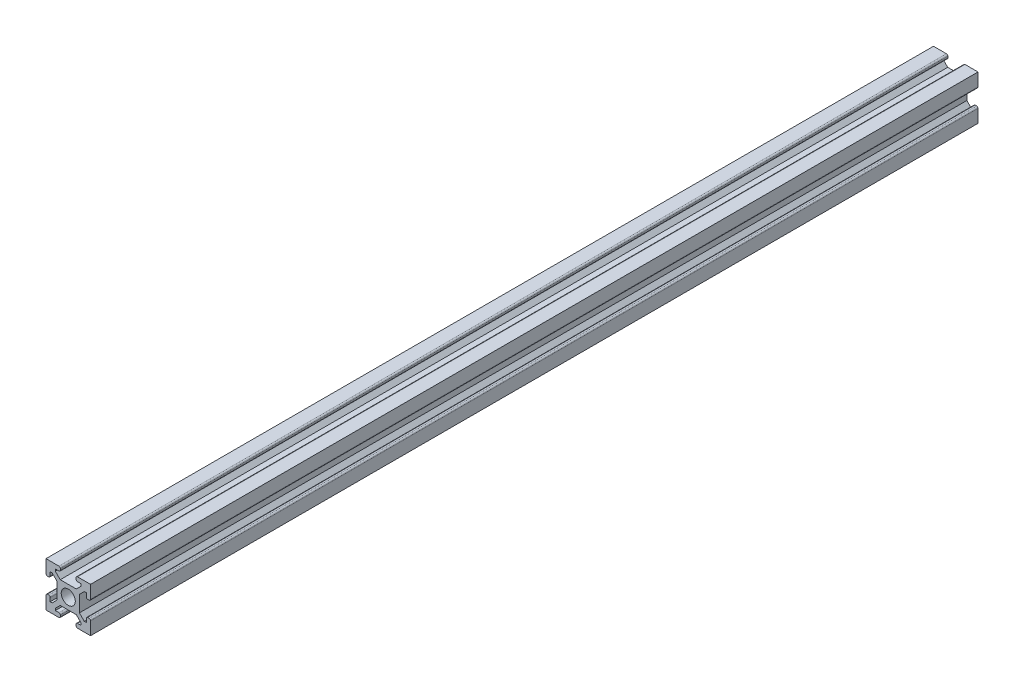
ISO-10303-21;
HEADER;
FILE_DESCRIPTION(('STEP AP214'),'2;1');
FILE_NAME('part.step','',(''),(''),'','','');
FILE_SCHEMA(('AUTOMOTIVE_DESIGN { 1 0 10303 214 1 1 1 1 }'));
ENDSEC;
DATA;
#1=APPLICATION_CONTEXT('core data for automotive mechanical design processes');
#2=APPLICATION_PROTOCOL_DEFINITION('international standard','automotive_design',2000,#1);
#3=PRODUCT_CONTEXT('',#1,'mechanical');
#4=PRODUCT('Part','Part','',(#3));
#5=PRODUCT_RELATED_PRODUCT_CATEGORY('part','',(#4));
#6=PRODUCT_DEFINITION_FORMATION('','',#4);
#7=PRODUCT_DEFINITION_CONTEXT('part definition',#1,'design');
#8=PRODUCT_DEFINITION('design','',#6,#7);
#9=PRODUCT_DEFINITION_SHAPE('','',#8);
#10=(LENGTH_UNIT() NAMED_UNIT(*) SI_UNIT(.MILLI.,.METRE.));
#11=(NAMED_UNIT(*) PLANE_ANGLE_UNIT() SI_UNIT($,.RADIAN.));
#12=(NAMED_UNIT(*) SI_UNIT($,.STERADIAN.) SOLID_ANGLE_UNIT());
#13=UNCERTAINTY_MEASURE_WITH_UNIT(LENGTH_MEASURE(1.E-05),#10,'distance_accuracy_value','');
#14=(GEOMETRIC_REPRESENTATION_CONTEXT(3) GLOBAL_UNCERTAINTY_ASSIGNED_CONTEXT((#13)) GLOBAL_UNIT_ASSIGNED_CONTEXT((#10,
#11,#12)) REPRESENTATION_CONTEXT('',''));
#15=CARTESIAN_POINT('',(0.,0.,0.));
#16=DIRECTION('',(0.,0.,1.));
#17=DIRECTION('',(1.,0.,0.));
#18=AXIS2_PLACEMENT_3D('',#15,#16,#17);
#19=CARTESIAN_POINT('',(10.033,0.,800.00094));
#20=DIRECTION('',(1.,0.,0.));
#21=DIRECTION('',(0.,0.,-1.));
#22=AXIS2_PLACEMENT_3D('',#19,#20,#21);
#23=PLANE('',#22);
#24=DIRECTION('',(0.,-1.,0.));
#25=VECTOR('',#24,1.);
#26=CARTESIAN_POINT('',(10.033,0.,0.));
#27=LINE('',#26,#25);
#28=CARTESIAN_POINT('',(10.033,7.23121319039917,0.));
#29=VERTEX_POINT('',#28);
#30=CARTESIAN_POINT('',(10.033,-7.23121319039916,0.));
#31=VERTEX_POINT('',#30);
#32=EDGE_CURVE('E419',#29,#31,#27,.T.);
#33=ORIENTED_EDGE('',*,*,#32,.F.);
#34=DIRECTION('',(0.,0.,-1.));
#35=VECTOR('',#34,1.);
#36=CARTESIAN_POINT('',(10.033,7.23121319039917,800.00094));
#37=LINE('',#36,#35);
#38=CARTESIAN_POINT('',(10.033,7.23121319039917,800.00094));
#39=VERTEX_POINT('',#38);
#40=EDGE_CURVE('E413',#39,#29,#37,.T.);
#41=ORIENTED_EDGE('',*,*,#40,.F.);
#42=DIRECTION('',(0.,-1.,0.));
#43=VECTOR('',#42,1.);
#44=CARTESIAN_POINT('',(10.033,0.,800.00094));
#45=LINE('',#44,#43);
#46=CARTESIAN_POINT('',(10.033,-7.23121319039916,800.00094));
#47=VERTEX_POINT('',#46);
#48=EDGE_CURVE('E416',#39,#47,#45,.T.);
#49=ORIENTED_EDGE('',*,*,#48,.T.);
#50=DIRECTION('',(0.,0.,-1.));
#51=VECTOR('',#50,1.);
#52=CARTESIAN_POINT('',(10.033,-7.23121319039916,800.00094));
#53=LINE('',#52,#51);
#54=EDGE_CURVE('E553',#47,#31,#53,.T.);
#55=ORIENTED_EDGE('',*,*,#54,.T.);
#56=EDGE_LOOP('',(#33,#41,#49,#55));
#57=FACE_BOUND('',#56,.T.);
#58=ADVANCED_FACE('F34',(#57),#23,.T.);
#59=CARTESIAN_POINT('',(1.40089340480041,-1.40089340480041,800.00094));
#60=DIRECTION('',(-0.707106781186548,0.707106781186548,0.));
#61=DIRECTION('',(-0.707106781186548,-0.707106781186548,0.));
#62=AXIS2_PLACEMENT_3D('',#59,#60,#61);
#63=PLANE('',#62);
#64=DIRECTION('',(0.707106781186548,0.707106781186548,0.));
#65=VECTOR('',#64,1.);
#66=CARTESIAN_POINT('',(1.40089340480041,-1.40089340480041,0.));
#67=LINE('',#66,#65);
#68=CARTESIAN_POINT('',(14.478,11.6762131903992,0.));
#69=VERTEX_POINT('',#68);
#70=EDGE_CURVE('E555',#29,#69,#67,.T.);
#71=ORIENTED_EDGE('',*,*,#70,.T.);
#72=DIRECTION('',(0.,0.,-1.));
#73=VECTOR('',#72,1.);
#74=CARTESIAN_POINT('',(14.478,11.6762131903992,800.00094));
#75=LINE('',#74,#73);
#76=CARTESIAN_POINT('',(14.478,11.6762131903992,800.00094));
#77=VERTEX_POINT('',#76);
#78=EDGE_CURVE('E423',#77,#69,#75,.T.);
#79=ORIENTED_EDGE('',*,*,#78,.F.);
#80=DIRECTION('',(0.707106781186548,0.707106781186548,0.));
#81=VECTOR('',#80,1.);
#82=CARTESIAN_POINT('',(1.40089340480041,-1.40089340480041,800.00094));
#83=LINE('',#82,#81);
#84=EDGE_CURVE('E426',#39,#77,#83,.T.);
#85=ORIENTED_EDGE('',*,*,#84,.F.);
#86=ORIENTED_EDGE('',*,*,#40,.T.);
#87=EDGE_LOOP('',(#71,#79,#85,#86));
#88=FACE_BOUND('',#87,.T.);
#89=ADVANCED_FACE('F427',(#88),#63,.F.);
#90=CARTESIAN_POINT('',(1.02528127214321E-13,11.6762131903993,800.00094));
#91=DIRECTION('',(0.,1.,0.));
#92=DIRECTION('',(-1.,0.,0.));
#93=AXIS2_PLACEMENT_3D('',#90,#91,#92);
#94=PLANE('',#93);
#95=DIRECTION('',(1.,0.,0.));
#96=VECTOR('',#95,1.);
#97=CARTESIAN_POINT('',(1.02528127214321E-13,11.6762131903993,0.));
#98=LINE('',#97,#96);
#99=CARTESIAN_POINT('',(16.256,11.6762131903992,0.));
#100=VERTEX_POINT('',#99);
#101=EDGE_CURVE('E557',#69,#100,#98,.T.);
#102=ORIENTED_EDGE('',*,*,#101,.T.);
#103=DIRECTION('',(0.,0.,-1.));
#104=VECTOR('',#103,1.);
#105=CARTESIAN_POINT('',(16.256,11.6762131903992,800.00094));
#106=LINE('',#105,#104);
#107=CARTESIAN_POINT('',(16.256,11.6762131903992,800.00094));
#108=VERTEX_POINT('',#107);
#109=EDGE_CURVE('E729',#108,#100,#106,.T.);
#110=ORIENTED_EDGE('',*,*,#109,.F.);
#111=DIRECTION('',(1.,0.,0.));
#112=VECTOR('',#111,1.);
#113=CARTESIAN_POINT('',(1.02528127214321E-13,11.6762131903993,800.00094));
#114=LINE('',#113,#112);
#115=EDGE_CURVE('E431',#77,#108,#114,.T.);
#116=ORIENTED_EDGE('',*,*,#115,.F.);
#117=ORIENTED_EDGE('',*,*,#78,.T.);
#118=EDGE_LOOP('',(#102,#110,#116,#117));
#119=FACE_BOUND('',#118,.T.);
#120=ADVANCED_FACE('F1051',(#119),#94,.F.);
#121=CARTESIAN_POINT('',(16.256,0.,800.00094));
#122=DIRECTION('',(-1.,0.,0.));
#123=DIRECTION('',(0.,-1.,0.));
#124=AXIS2_PLACEMENT_3D('',#121,#122,#123);
#125=PLANE('',#124);
#126=DIRECTION('',(0.,1.,0.));
#127=VECTOR('',#126,1.);
#128=CARTESIAN_POINT('',(16.256,0.,0.));
#129=LINE('',#128,#127);
#130=CARTESIAN_POINT('',(16.256,8.37421319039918,0.));
#131=VERTEX_POINT('',#130);
#132=EDGE_CURVE('E560',#131,#100,#129,.T.);
#133=ORIENTED_EDGE('',*,*,#132,.F.);
#134=DIRECTION('',(0.,0.,-1.));
#135=VECTOR('',#134,1.);
#136=CARTESIAN_POINT('',(16.256,8.37421319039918,800.00094));
#137=LINE('',#136,#135);
#138=CARTESIAN_POINT('',(16.256,8.37421319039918,800.00094));
#139=VERTEX_POINT('',#138);
#140=EDGE_CURVE('E852',#131,#139,#137,.F.);
#141=ORIENTED_EDGE('',*,*,#140,.T.);
#142=DIRECTION('',(0.,1.,0.));
#143=VECTOR('',#142,1.);
#144=CARTESIAN_POINT('',(16.256,0.,800.00094));
#145=LINE('',#144,#143);
#146=EDGE_CURVE('E446',#139,#108,#145,.T.);
#147=ORIENTED_EDGE('',*,*,#146,.T.);
#148=ORIENTED_EDGE('',*,*,#109,.T.);
#149=EDGE_LOOP('',(#133,#141,#147,#148));
#150=FACE_BOUND('',#149,.T.);
#151=ADVANCED_FACE('F1478',(#150),#125,.T.);
#152=CARTESIAN_POINT('',(0.,7.10421319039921,800.00094));
#153=DIRECTION('',(0.,-1.,0.));
#154=DIRECTION('',(1.,0.,0.));
#155=AXIS2_PLACEMENT_3D('',#152,#153,#154);
#156=PLANE('',#155);
#157=DIRECTION('',(-1.,0.,0.));
#158=VECTOR('',#157,1.);
#159=CARTESIAN_POINT('',(0.,7.10421319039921,0.));
#160=LINE('',#159,#158);
#161=CARTESIAN_POINT('',(18.796,7.10421319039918,0.));
#162=VERTEX_POINT('',#161);
#163=CARTESIAN_POINT('',(17.526,7.10421319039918,0.));
#164=VERTEX_POINT('',#163);
#165=EDGE_CURVE('E562',#162,#164,#160,.T.);
#166=ORIENTED_EDGE('',*,*,#165,.F.);
#167=DIRECTION('',(0.,0.,-1.));
#168=VECTOR('',#167,1.);
#169=CARTESIAN_POINT('',(18.796,7.10421319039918,800.00094));
#170=LINE('',#169,#168);
#171=CARTESIAN_POINT('',(18.796,7.10421319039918,800.00094));
#172=VERTEX_POINT('',#171);
#173=EDGE_CURVE('E850',#162,#172,#170,.F.);
#174=ORIENTED_EDGE('',*,*,#173,.T.);
#175=DIRECTION('',(-1.,0.,0.));
#176=VECTOR('',#175,1.);
#177=CARTESIAN_POINT('',(0.,7.10421319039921,800.00094));
#178=LINE('',#177,#176);
#179=CARTESIAN_POINT('',(17.526,7.10421319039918,800.00094));
#180=VERTEX_POINT('',#179);
#181=EDGE_CURVE('E448',#172,#180,#178,.T.);
#182=ORIENTED_EDGE('',*,*,#181,.T.);
#183=DIRECTION('',(0.,0.,-1.));
#184=VECTOR('',#183,1.);
#185=CARTESIAN_POINT('',(17.526,7.10421319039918,800.00094));
#186=LINE('',#185,#184);
#187=EDGE_CURVE('E847',#180,#164,#186,.T.);
#188=ORIENTED_EDGE('',*,*,#187,.T.);
#189=EDGE_LOOP('',(#166,#174,#182,#188));
#190=FACE_BOUND('',#189,.T.);
#191=ADVANCED_FACE('F1063',(#190),#156,.T.);
#192=CARTESIAN_POINT('',(20.066,0.,800.00094));
#193=DIRECTION('',(1.,0.,0.));
#194=DIRECTION('',(0.,0.,-1.));
#195=AXIS2_PLACEMENT_3D('',#192,#193,#194);
#196=PLANE('',#195);
#197=DIRECTION('',(0.,-1.,0.));
#198=VECTOR('',#197,1.);
#199=CARTESIAN_POINT('',(20.066,0.,800.00094));
#200=LINE('',#199,#198);
#201=CARTESIAN_POINT('',(20.066,20.066,800.00094));
#202=VERTEX_POINT('',#201);
#203=CARTESIAN_POINT('',(20.066,8.37421319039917,800.00094));
#204=VERTEX_POINT('',#203);
#205=EDGE_CURVE('E451',#202,#204,#200,.T.);
#206=ORIENTED_EDGE('',*,*,#205,.T.);
#207=DIRECTION('',(0.,0.,-1.));
#208=VECTOR('',#207,1.);
#209=CARTESIAN_POINT('',(20.066,8.37421319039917,800.00094));
#210=LINE('',#209,#208);
#211=CARTESIAN_POINT('',(20.066,8.37421319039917,0.));
#212=VERTEX_POINT('',#211);
#213=EDGE_CURVE('E844',#204,#212,#210,.T.);
#214=ORIENTED_EDGE('',*,*,#213,.T.);
#215=DIRECTION('',(0.,-1.,0.));
#216=VECTOR('',#215,1.);
#217=CARTESIAN_POINT('',(20.066,0.,0.));
#218=LINE('',#217,#216);
#219=CARTESIAN_POINT('',(20.066,20.066,0.));
#220=VERTEX_POINT('',#219);
#221=EDGE_CURVE('E565',#220,#212,#218,.T.);
#222=ORIENTED_EDGE('',*,*,#221,.F.);
#223=DIRECTION('',(0.,0.,-1.));
#224=VECTOR('',#223,1.);
#225=CARTESIAN_POINT('',(20.066,20.066,800.00094));
#226=LINE('',#225,#224);
#227=EDGE_CURVE('E726',#202,#220,#226,.T.);
#228=ORIENTED_EDGE('',*,*,#227,.F.);
#229=EDGE_LOOP('',(#206,#214,#222,#228));
#230=FACE_BOUND('',#229,.T.);
#231=ADVANCED_FACE('F1072',(#230),#196,.T.);
#232=CARTESIAN_POINT('',(0.,20.066,800.00094));
#233=DIRECTION('',(0.,1.,0.));
#234=DIRECTION('',(0.,0.,1.));
#235=AXIS2_PLACEMENT_3D('',#232,#233,#234);
#236=PLANE('',#235);
#237=DIRECTION('',(1.,0.,0.));
#238=VECTOR('',#237,1.);
#239=CARTESIAN_POINT('',(0.,20.066,0.));
#240=LINE('',#239,#238);
#241=CARTESIAN_POINT('',(8.37421319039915,20.066,0.));
#242=VERTEX_POINT('',#241);
#243=EDGE_CURVE('E568',#242,#220,#240,.T.);
#244=ORIENTED_EDGE('',*,*,#243,.F.);
#245=DIRECTION('',(0.,0.,-1.));
#246=VECTOR('',#245,1.);
#247=CARTESIAN_POINT('',(8.37421319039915,20.066,800.00094));
#248=LINE('',#247,#246);
#249=CARTESIAN_POINT('',(8.37421319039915,20.066,800.00094));
#250=VERTEX_POINT('',#249);
#251=EDGE_CURVE('E862',#242,#250,#248,.F.);
#252=ORIENTED_EDGE('',*,*,#251,.T.);
#253=DIRECTION('',(1.,0.,0.));
#254=VECTOR('',#253,1.);
#255=CARTESIAN_POINT('',(0.,20.066,800.00094));
#256=LINE('',#255,#254);
#257=EDGE_CURVE('E454',#250,#202,#256,.T.);
#258=ORIENTED_EDGE('',*,*,#257,.T.);
#259=ORIENTED_EDGE('',*,*,#227,.T.);
#260=EDGE_LOOP('',(#244,#252,#258,#259));
#261=FACE_BOUND('',#260,.T.);
#262=ADVANCED_FACE('F1453',(#261),#236,.T.);
#263=CARTESIAN_POINT('',(7.10421319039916,0.,800.00094));
#264=DIRECTION('',(1.,0.,0.));
#265=DIRECTION('',(0.,1.,0.));
#266=AXIS2_PLACEMENT_3D('',#263,#264,#265);
#267=PLANE('',#266);
#268=DIRECTION('',(0.,-1.,0.));
#269=VECTOR('',#268,1.);
#270=CARTESIAN_POINT('',(7.10421319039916,0.,0.));
#271=LINE('',#270,#269);
#272=CARTESIAN_POINT('',(7.10421319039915,18.796,0.));
#273=VERTEX_POINT('',#272);
#274=CARTESIAN_POINT('',(7.10421319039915,17.526,0.));
#275=VERTEX_POINT('',#274);
#276=EDGE_CURVE('E570',#273,#275,#271,.T.);
#277=ORIENTED_EDGE('',*,*,#276,.T.);
#278=DIRECTION('',(0.,0.,-1.));
#279=VECTOR('',#278,1.);
#280=CARTESIAN_POINT('',(7.10421319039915,17.526,800.00094));
#281=LINE('',#280,#279);
#282=CARTESIAN_POINT('',(7.10421319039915,17.526,800.00094));
#283=VERTEX_POINT('',#282);
#284=EDGE_CURVE('E860',#275,#283,#281,.F.);
#285=ORIENTED_EDGE('',*,*,#284,.T.);
#286=DIRECTION('',(0.,-1.,0.));
#287=VECTOR('',#286,1.);
#288=CARTESIAN_POINT('',(7.10421319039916,0.,800.00094));
#289=LINE('',#288,#287);
#290=CARTESIAN_POINT('',(7.10421319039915,18.796,800.00094));
#291=VERTEX_POINT('',#290);
#292=EDGE_CURVE('E456',#291,#283,#289,.T.);
#293=ORIENTED_EDGE('',*,*,#292,.F.);
#294=DIRECTION('',(0.,0.,-1.));
#295=VECTOR('',#294,1.);
#296=CARTESIAN_POINT('',(7.10421319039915,18.796,0.));
#297=LINE('',#296,#295);
#298=EDGE_CURVE('E857',#291,#273,#297,.T.);
#299=ORIENTED_EDGE('',*,*,#298,.T.);
#300=EDGE_LOOP('',(#277,#285,#293,#299));
#301=FACE_BOUND('',#300,.T.);
#302=ADVANCED_FACE('F1085',(#301),#267,.F.);
#303=CARTESIAN_POINT('',(0.,16.256,800.00094));
#304=DIRECTION('',(0.,1.,0.));
#305=DIRECTION('',(0.,0.,1.));
#306=AXIS2_PLACEMENT_3D('',#303,#304,#305);
#307=PLANE('',#306);
#308=DIRECTION('',(1.,0.,0.));
#309=VECTOR('',#308,1.);
#310=CARTESIAN_POINT('',(0.,16.256,800.00094));
#311=LINE('',#310,#309);
#312=CARTESIAN_POINT('',(8.37421319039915,16.256,800.00094));
#313=VERTEX_POINT('',#312);
#314=CARTESIAN_POINT('',(11.6762131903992,16.256,800.00094));
#315=VERTEX_POINT('',#314);
#316=EDGE_CURVE('E459',#313,#315,#311,.T.);
#317=ORIENTED_EDGE('',*,*,#316,.F.);
#318=DIRECTION('',(0.,0.,-1.));
#319=VECTOR('',#318,1.);
#320=CARTESIAN_POINT('',(8.37421319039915,16.256,800.00094));
#321=LINE('',#320,#319);
#322=CARTESIAN_POINT('',(8.37421319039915,16.256,0.));
#323=VERTEX_POINT('',#322);
#324=EDGE_CURVE('E854',#313,#323,#321,.T.);
#325=ORIENTED_EDGE('',*,*,#324,.T.);
#326=DIRECTION('',(1.,0.,0.));
#327=VECTOR('',#326,1.);
#328=CARTESIAN_POINT('',(0.,16.256,0.));
#329=LINE('',#328,#327);
#330=CARTESIAN_POINT('',(11.6762131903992,16.256,0.));
#331=VERTEX_POINT('',#330);
#332=EDGE_CURVE('E573',#323,#331,#329,.T.);
#333=ORIENTED_EDGE('',*,*,#332,.T.);
#334=DIRECTION('',(0.,0.,-1.));
#335=VECTOR('',#334,1.);
#336=CARTESIAN_POINT('',(11.6762131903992,16.256,800.00094));
#337=LINE('',#336,#335);
#338=EDGE_CURVE('E723',#315,#331,#337,.T.);
#339=ORIENTED_EDGE('',*,*,#338,.F.);
#340=EDGE_LOOP('',(#317,#325,#333,#339));
#341=FACE_BOUND('',#340,.T.);
#342=ADVANCED_FACE('F1095',(#341),#307,.F.);
#343=CARTESIAN_POINT('',(11.6762131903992,0.,800.00094));
#344=DIRECTION('',(-1.,0.,0.));
#345=DIRECTION('',(0.,0.,1.));
#346=AXIS2_PLACEMENT_3D('',#343,#344,#345);
#347=PLANE('',#346);
#348=DIRECTION('',(0.,1.,0.));
#349=VECTOR('',#348,1.);
#350=CARTESIAN_POINT('',(11.6762131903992,0.,0.));
#351=LINE('',#350,#349);
#352=CARTESIAN_POINT('',(11.6762131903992,14.478,0.));
#353=VERTEX_POINT('',#352);
#354=EDGE_CURVE('E575',#353,#331,#351,.T.);
#355=ORIENTED_EDGE('',*,*,#354,.F.);
#356=DIRECTION('',(0.,0.,-1.));
#357=VECTOR('',#356,1.);
#358=CARTESIAN_POINT('',(11.6762131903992,14.478,800.00094));
#359=LINE('',#358,#357);
#360=CARTESIAN_POINT('',(11.6762131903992,14.478,800.00094));
#361=VERTEX_POINT('',#360);
#362=EDGE_CURVE('E721',#361,#353,#359,.T.);
#363=ORIENTED_EDGE('',*,*,#362,.F.);
#364=DIRECTION('',(0.,1.,0.));
#365=VECTOR('',#364,1.);
#366=CARTESIAN_POINT('',(11.6762131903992,0.,800.00094));
#367=LINE('',#366,#365);
#368=EDGE_CURVE('E461',#361,#315,#367,.T.);
#369=ORIENTED_EDGE('',*,*,#368,.T.);
#370=ORIENTED_EDGE('',*,*,#338,.T.);
#371=EDGE_LOOP('',(#355,#363,#369,#370));
#372=FACE_BOUND('',#371,.T.);
#373=ADVANCED_FACE('F1116',(#372),#347,.T.);
#374=CARTESIAN_POINT('',(-1.40089340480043,1.40089340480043,800.00094));
#375=DIRECTION('',(-0.707106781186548,0.707106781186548,0.));
#376=DIRECTION('',(-0.707106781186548,-0.707106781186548,0.));
#377=AXIS2_PLACEMENT_3D('',#374,#375,#376);
#378=PLANE('',#377);
#379=DIRECTION('',(0.707106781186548,0.707106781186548,0.));
#380=VECTOR('',#379,1.);
#381=CARTESIAN_POINT('',(-1.40089340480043,1.40089340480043,0.));
#382=LINE('',#381,#380);
#383=CARTESIAN_POINT('',(7.23121319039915,10.033,0.));
#384=VERTEX_POINT('',#383);
#385=EDGE_CURVE('E578',#384,#353,#382,.T.);
#386=ORIENTED_EDGE('',*,*,#385,.F.);
#387=DIRECTION('',(0.,0.,-1.));
#388=VECTOR('',#387,1.);
#389=CARTESIAN_POINT('',(7.23121319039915,10.033,800.00094));
#390=LINE('',#389,#388);
#391=CARTESIAN_POINT('',(7.23121319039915,10.033,800.00094));
#392=VERTEX_POINT('',#391);
#393=EDGE_CURVE('E719',#392,#384,#390,.T.);
#394=ORIENTED_EDGE('',*,*,#393,.F.);
#395=DIRECTION('',(0.707106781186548,0.707106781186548,0.));
#396=VECTOR('',#395,1.);
#397=CARTESIAN_POINT('',(-1.40089340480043,1.40089340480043,800.00094));
#398=LINE('',#397,#396);
#399=EDGE_CURVE('E464',#392,#361,#398,.T.);
#400=ORIENTED_EDGE('',*,*,#399,.T.);
#401=ORIENTED_EDGE('',*,*,#362,.T.);
#402=EDGE_LOOP('',(#386,#394,#400,#401));
#403=FACE_BOUND('',#402,.T.);
#404=ADVANCED_FACE('F1103',(#403),#378,.T.);
#405=CARTESIAN_POINT('',(0.,10.033,800.00094));
#406=DIRECTION('',(0.,1.,0.));
#407=DIRECTION('',(0.,0.,1.));
#408=AXIS2_PLACEMENT_3D('',#405,#406,#407);
#409=PLANE('',#408);
#410=DIRECTION('',(1.,0.,0.));
#411=VECTOR('',#410,1.);
#412=CARTESIAN_POINT('',(0.,10.033,0.));
#413=LINE('',#412,#411);
#414=CARTESIAN_POINT('',(-7.23121319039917,10.033,0.));
#415=VERTEX_POINT('',#414);
#416=EDGE_CURVE('E581',#415,#384,#413,.T.);
#417=ORIENTED_EDGE('',*,*,#416,.F.);
#418=DIRECTION('',(0.,0.,-1.));
#419=VECTOR('',#418,1.);
#420=CARTESIAN_POINT('',(-7.23121319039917,10.033,800.00094));
#421=LINE('',#420,#419);
#422=CARTESIAN_POINT('',(-7.23121319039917,10.033,800.00094));
#423=VERTEX_POINT('',#422);
#424=EDGE_CURVE('E717',#423,#415,#421,.T.);
#425=ORIENTED_EDGE('',*,*,#424,.F.);
#426=DIRECTION('',(1.,0.,0.));
#427=VECTOR('',#426,1.);
#428=CARTESIAN_POINT('',(0.,10.033,800.00094));
#429=LINE('',#428,#427);
#430=EDGE_CURVE('E467',#423,#392,#429,.T.);
#431=ORIENTED_EDGE('',*,*,#430,.T.);
#432=ORIENTED_EDGE('',*,*,#393,.T.);
#433=EDGE_LOOP('',(#417,#425,#431,#432));
#434=FACE_BOUND('',#433,.T.);
#435=ADVANCED_FACE('F1107',(#434),#409,.T.);
#436=CARTESIAN_POINT('',(1.40089340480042,1.40089340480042,800.00094));
#437=DIRECTION('',(-0.707106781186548,-0.707106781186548,0.));
#438=DIRECTION('',(0.707106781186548,-0.707106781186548,0.));
#439=AXIS2_PLACEMENT_3D('',#436,#437,#438);
#440=PLANE('',#439);
#441=DIRECTION('',(-0.707106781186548,0.707106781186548,0.));
#442=VECTOR('',#441,1.);
#443=CARTESIAN_POINT('',(1.40089340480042,1.40089340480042,0.));
#444=LINE('',#443,#442);
#445=CARTESIAN_POINT('',(-11.6762131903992,14.478,0.));
#446=VERTEX_POINT('',#445);
#447=EDGE_CURVE('E584',#415,#446,#444,.T.);
#448=ORIENTED_EDGE('',*,*,#447,.T.);
#449=DIRECTION('',(0.,0.,-1.));
#450=VECTOR('',#449,1.);
#451=CARTESIAN_POINT('',(-11.6762131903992,14.478,800.00094));
#452=LINE('',#451,#450);
#453=CARTESIAN_POINT('',(-11.6762131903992,14.478,800.00094));
#454=VERTEX_POINT('',#453);
#455=EDGE_CURVE('E714',#454,#446,#452,.T.);
#456=ORIENTED_EDGE('',*,*,#455,.F.);
#457=DIRECTION('',(-0.707106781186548,0.707106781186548,0.));
#458=VECTOR('',#457,1.);
#459=CARTESIAN_POINT('',(1.40089340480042,1.40089340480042,800.00094));
#460=LINE('',#459,#458);
#461=EDGE_CURVE('E470',#423,#454,#460,.T.);
#462=ORIENTED_EDGE('',*,*,#461,.F.);
#463=ORIENTED_EDGE('',*,*,#424,.T.);
#464=EDGE_LOOP('',(#448,#456,#462,#463));
#465=FACE_BOUND('',#464,.T.);
#466=ADVANCED_FACE('F1111',(#465),#440,.F.);
#467=CARTESIAN_POINT('',(-11.6762131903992,0.,800.00094));
#468=DIRECTION('',(-1.,0.,0.));
#469=DIRECTION('',(0.,0.,1.));
#470=AXIS2_PLACEMENT_3D('',#467,#468,#469);
#471=PLANE('',#470);
#472=DIRECTION('',(0.,1.,0.));
#473=VECTOR('',#472,1.);
#474=CARTESIAN_POINT('',(-11.6762131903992,0.,0.));
#475=LINE('',#474,#473);
#476=CARTESIAN_POINT('',(-11.6762131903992,16.256,0.));
#477=VERTEX_POINT('',#476);
#478=EDGE_CURVE('E586',#446,#477,#475,.T.);
#479=ORIENTED_EDGE('',*,*,#478,.T.);
#480=DIRECTION('',(0.,0.,-1.));
#481=VECTOR('',#480,1.);
#482=CARTESIAN_POINT('',(-11.6762131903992,16.256,800.00094));
#483=LINE('',#482,#481);
#484=CARTESIAN_POINT('',(-11.6762131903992,16.256,800.00094));
#485=VERTEX_POINT('',#484);
#486=EDGE_CURVE('E711',#485,#477,#483,.T.);
#487=ORIENTED_EDGE('',*,*,#486,.F.);
#488=DIRECTION('',(0.,1.,0.));
#489=VECTOR('',#488,1.);
#490=CARTESIAN_POINT('',(-11.6762131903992,0.,800.00094));
#491=LINE('',#490,#489);
#492=EDGE_CURVE('E472',#454,#485,#491,.T.);
#493=ORIENTED_EDGE('',*,*,#492,.F.);
#494=ORIENTED_EDGE('',*,*,#455,.T.);
#495=EDGE_LOOP('',(#479,#487,#493,#494));
#496=FACE_BOUND('',#495,.T.);
#497=ADVANCED_FACE('F1115',(#496),#471,.F.);
#498=CARTESIAN_POINT('',(0.,16.256,800.00094));
#499=DIRECTION('',(0.,-1.,0.));
#500=DIRECTION('',(0.,0.,-1.));
#501=AXIS2_PLACEMENT_3D('',#498,#499,#500);
#502=PLANE('',#501);
#503=DIRECTION('',(-1.,0.,0.));
#504=VECTOR('',#503,1.);
#505=CARTESIAN_POINT('',(0.,16.256,0.));
#506=LINE('',#505,#504);
#507=CARTESIAN_POINT('',(-8.37421319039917,16.256,0.));
#508=VERTEX_POINT('',#507);
#509=EDGE_CURVE('E589',#508,#477,#506,.T.);
#510=ORIENTED_EDGE('',*,*,#509,.F.);
#511=DIRECTION('',(0.,0.,-1.));
#512=VECTOR('',#511,1.);
#513=CARTESIAN_POINT('',(-8.37421319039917,16.256,800.00094));
#514=LINE('',#513,#512);
#515=CARTESIAN_POINT('',(-8.37421319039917,16.256,800.00094));
#516=VERTEX_POINT('',#515);
#517=EDGE_CURVE('E42',#508,#516,#514,.F.);
#518=ORIENTED_EDGE('',*,*,#517,.T.);
#519=DIRECTION('',(-1.,0.,0.));
#520=VECTOR('',#519,1.);
#521=CARTESIAN_POINT('',(0.,16.256,800.00094));
#522=LINE('',#521,#520);
#523=EDGE_CURVE('E475',#516,#485,#522,.T.);
#524=ORIENTED_EDGE('',*,*,#523,.T.);
#525=ORIENTED_EDGE('',*,*,#486,.T.);
#526=EDGE_LOOP('',(#510,#518,#524,#525));
#527=FACE_BOUND('',#526,.T.);
#528=ADVANCED_FACE('F872',(#527),#502,.T.);
#529=CARTESIAN_POINT('',(-7.10421319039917,0.,800.00094));
#530=DIRECTION('',(1.,0.,0.));
#531=DIRECTION('',(0.,1.,0.));
#532=AXIS2_PLACEMENT_3D('',#529,#530,#531);
#533=PLANE('',#532);
#534=DIRECTION('',(0.,-1.,0.));
#535=VECTOR('',#534,1.);
#536=CARTESIAN_POINT('',(-7.10421319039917,0.,800.00094));
#537=LINE('',#536,#535);
#538=CARTESIAN_POINT('',(-7.10421319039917,18.796,800.00094));
#539=VERTEX_POINT('',#538);
#540=CARTESIAN_POINT('',(-7.10421319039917,17.526,800.00094));
#541=VERTEX_POINT('',#540);
#542=EDGE_CURVE('E477',#539,#541,#537,.T.);
#543=ORIENTED_EDGE('',*,*,#542,.T.);
#544=DIRECTION('',(0.,0.,-1.));
#545=VECTOR('',#544,1.);
#546=CARTESIAN_POINT('',(-7.10421319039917,17.526,800.00094));
#547=LINE('',#546,#545);
#548=CARTESIAN_POINT('',(-7.10421319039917,17.526,0.));
#549=VERTEX_POINT('',#548);
#550=EDGE_CURVE('E866',#541,#549,#547,.T.);
#551=ORIENTED_EDGE('',*,*,#550,.T.);
#552=DIRECTION('',(0.,-1.,0.));
#553=VECTOR('',#552,1.);
#554=CARTESIAN_POINT('',(-7.10421319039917,0.,0.));
#555=LINE('',#554,#553);
#556=CARTESIAN_POINT('',(-7.10421319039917,18.796,0.));
#557=VERTEX_POINT('',#556);
#558=EDGE_CURVE('E591',#557,#549,#555,.T.);
#559=ORIENTED_EDGE('',*,*,#558,.F.);
#560=DIRECTION('',(0.,0.,-1.));
#561=VECTOR('',#560,1.);
#562=CARTESIAN_POINT('',(-7.10421319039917,18.796,800.00094));
#563=LINE('',#562,#561);
#564=EDGE_CURVE('E864',#557,#539,#563,.F.);
#565=ORIENTED_EDGE('',*,*,#564,.T.);
#566=EDGE_LOOP('',(#543,#551,#559,#565));
#567=FACE_BOUND('',#566,.T.);
#568=ADVANCED_FACE('F882',(#567),#533,.T.);
#569=CARTESIAN_POINT('',(0.,20.066,800.00094));
#570=DIRECTION('',(0.,1.,0.));
#571=DIRECTION('',(0.,0.,1.));
#572=AXIS2_PLACEMENT_3D('',#569,#570,#571);
#573=PLANE('',#572);
#574=DIRECTION('',(1.,0.,0.));
#575=VECTOR('',#574,1.);
#576=CARTESIAN_POINT('',(0.,20.066,800.00094));
#577=LINE('',#576,#575);
#578=CARTESIAN_POINT('',(-20.066,20.066,800.00094));
#579=VERTEX_POINT('',#578);
#580=CARTESIAN_POINT('',(-8.37421319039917,20.066,800.00094));
#581=VERTEX_POINT('',#580);
#582=EDGE_CURVE('E480',#579,#581,#577,.T.);
#583=ORIENTED_EDGE('',*,*,#582,.T.);
#584=DIRECTION('',(0.,0.,-1.));
#585=VECTOR('',#584,1.);
#586=CARTESIAN_POINT('',(-8.37421319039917,20.066,800.00094));
#587=LINE('',#586,#585);
#588=CARTESIAN_POINT('',(-8.37421319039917,20.066,0.));
#589=VERTEX_POINT('',#588);
#590=EDGE_CURVE('E11',#581,#589,#587,.T.);
#591=ORIENTED_EDGE('',*,*,#590,.T.);
#592=DIRECTION('',(1.,0.,0.));
#593=VECTOR('',#592,1.);
#594=CARTESIAN_POINT('',(0.,20.066,0.));
#595=LINE('',#594,#593);
#596=CARTESIAN_POINT('',(-20.066,20.066,0.));
#597=VERTEX_POINT('',#596);
#598=EDGE_CURVE('E594',#597,#589,#595,.T.);
#599=ORIENTED_EDGE('',*,*,#598,.F.);
#600=DIRECTION('',(0.,0.,-1.));
#601=VECTOR('',#600,1.);
#602=CARTESIAN_POINT('',(-20.066,20.066,800.00094));
#603=LINE('',#602,#601);
#604=EDGE_CURVE('E709',#579,#597,#603,.T.);
#605=ORIENTED_EDGE('',*,*,#604,.F.);
#606=EDGE_LOOP('',(#583,#591,#599,#605));
#607=FACE_BOUND('',#606,.T.);
#608=ADVANCED_FACE('F893',(#607),#573,.T.);
#609=CARTESIAN_POINT('',(-20.066,0.,800.00094));
#610=DIRECTION('',(1.,0.,0.));
#611=DIRECTION('',(0.,0.,-1.));
#612=AXIS2_PLACEMENT_3D('',#609,#610,#611);
#613=PLANE('',#612);
#614=DIRECTION('',(0.,-1.,0.));
#615=VECTOR('',#614,1.);
#616=CARTESIAN_POINT('',(-20.066,0.,0.));
#617=LINE('',#616,#615);
#618=CARTESIAN_POINT('',(-20.066,8.37421319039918,0.));
#619=VERTEX_POINT('',#618);
#620=EDGE_CURVE('E597',#597,#619,#617,.T.);
#621=ORIENTED_EDGE('',*,*,#620,.T.);
#622=DIRECTION('',(0.,0.,-1.));
#623=VECTOR('',#622,1.);
#624=CARTESIAN_POINT('',(-20.066,8.37421319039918,800.00094));
#625=LINE('',#624,#623);
#626=CARTESIAN_POINT('',(-20.066,8.37421319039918,800.00094));
#627=VERTEX_POINT('',#626);
#628=EDGE_CURVE('E810',#619,#627,#625,.F.);
#629=ORIENTED_EDGE('',*,*,#628,.T.);
#630=DIRECTION('',(0.,-1.,0.));
#631=VECTOR('',#630,1.);
#632=CARTESIAN_POINT('',(-20.066,0.,800.00094));
#633=LINE('',#632,#631);
#634=EDGE_CURVE('E483',#579,#627,#633,.T.);
#635=ORIENTED_EDGE('',*,*,#634,.F.);
#636=ORIENTED_EDGE('',*,*,#604,.T.);
#637=EDGE_LOOP('',(#621,#629,#635,#636));
#638=FACE_BOUND('',#637,.T.);
#639=ADVANCED_FACE('F1403',(#638),#613,.F.);
#640=CARTESIAN_POINT('',(0.,7.10421319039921,800.00094));
#641=DIRECTION('',(0.,1.,0.));
#642=DIRECTION('',(-1.,0.,0.));
#643=AXIS2_PLACEMENT_3D('',#640,#641,#642);
#644=PLANE('',#643);
#645=DIRECTION('',(1.,0.,0.));
#646=VECTOR('',#645,1.);
#647=CARTESIAN_POINT('',(0.,7.10421319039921,800.00094));
#648=LINE('',#647,#646);
#649=CARTESIAN_POINT('',(-18.796,7.10421319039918,800.00094));
#650=VERTEX_POINT('',#649);
#651=CARTESIAN_POINT('',(-17.526,7.10421319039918,800.00094));
#652=VERTEX_POINT('',#651);
#653=EDGE_CURVE('E486',#650,#652,#648,.T.);
#654=ORIENTED_EDGE('',*,*,#653,.F.);
#655=DIRECTION('',(0.,0.,-1.));
#656=VECTOR('',#655,1.);
#657=CARTESIAN_POINT('',(-18.796,7.10421319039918,800.00094));
#658=LINE('',#657,#656);
#659=CARTESIAN_POINT('',(-18.796,7.10421319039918,0.));
#660=VERTEX_POINT('',#659);
#661=EDGE_CURVE('E807',#650,#660,#658,.T.);
#662=ORIENTED_EDGE('',*,*,#661,.T.);
#663=DIRECTION('',(1.,0.,0.));
#664=VECTOR('',#663,1.);
#665=CARTESIAN_POINT('',(0.,7.10421319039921,0.));
#666=LINE('',#665,#664);
#667=CARTESIAN_POINT('',(-17.526,7.10421319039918,0.));
#668=VERTEX_POINT('',#667);
#669=EDGE_CURVE('E600',#660,#668,#666,.T.);
#670=ORIENTED_EDGE('',*,*,#669,.T.);
#671=DIRECTION('',(0.,0.,-1.));
#672=VECTOR('',#671,1.);
#673=CARTESIAN_POINT('',(-17.526,7.10421319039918,800.00094));
#674=LINE('',#673,#672);
#675=EDGE_CURVE('E805',#668,#652,#674,.F.);
#676=ORIENTED_EDGE('',*,*,#675,.T.);
#677=EDGE_LOOP('',(#654,#662,#670,#676));
#678=FACE_BOUND('',#677,.T.);
#679=ADVANCED_FACE('F905',(#678),#644,.F.);
#680=CARTESIAN_POINT('',(-16.256,0.,800.00094));
#681=DIRECTION('',(-1.,0.,0.));
#682=DIRECTION('',(0.,-1.,0.));
#683=AXIS2_PLACEMENT_3D('',#680,#681,#682);
#684=PLANE('',#683);
#685=DIRECTION('',(0.,1.,0.));
#686=VECTOR('',#685,1.);
#687=CARTESIAN_POINT('',(-16.256,0.,800.00094));
#688=LINE('',#687,#686);
#689=CARTESIAN_POINT('',(-16.256,8.37421319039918,800.00094));
#690=VERTEX_POINT('',#689);
#691=CARTESIAN_POINT('',(-16.256,11.6762131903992,800.00094));
#692=VERTEX_POINT('',#691);
#693=EDGE_CURVE('E489',#690,#692,#688,.T.);
#694=ORIENTED_EDGE('',*,*,#693,.F.);
#695=DIRECTION('',(0.,0.,-1.));
#696=VECTOR('',#695,1.);
#697=CARTESIAN_POINT('',(-16.256,8.37421319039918,800.00094));
#698=LINE('',#697,#696);
#699=CARTESIAN_POINT('',(-16.256,8.37421319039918,0.));
#700=VERTEX_POINT('',#699);
#701=EDGE_CURVE('E812',#690,#700,#698,.T.);
#702=ORIENTED_EDGE('',*,*,#701,.T.);
#703=DIRECTION('',(0.,1.,0.));
#704=VECTOR('',#703,1.);
#705=CARTESIAN_POINT('',(-16.256,0.,0.));
#706=LINE('',#705,#704);
#707=CARTESIAN_POINT('',(-16.256,11.6762131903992,0.));
#708=VERTEX_POINT('',#707);
#709=EDGE_CURVE('E603',#700,#708,#706,.T.);
#710=ORIENTED_EDGE('',*,*,#709,.T.);
#711=DIRECTION('',(0.,0.,-1.));
#712=VECTOR('',#711,1.);
#713=CARTESIAN_POINT('',(-16.256,11.6762131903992,800.00094));
#714=LINE('',#713,#712);
#715=EDGE_CURVE('E706',#692,#708,#714,.T.);
#716=ORIENTED_EDGE('',*,*,#715,.F.);
#717=EDGE_LOOP('',(#694,#702,#710,#716));
#718=FACE_BOUND('',#717,.T.);
#719=ADVANCED_FACE('F914',(#718),#684,.F.);
#720=CARTESIAN_POINT('',(-1.02528127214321E-13,11.6762131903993,800.00094));
#721=DIRECTION('',(0.,-1.,0.));
#722=DIRECTION('',(1.,0.,0.));
#723=AXIS2_PLACEMENT_3D('',#720,#721,#722);
#724=PLANE('',#723);
#725=DIRECTION('',(-1.,0.,0.));
#726=VECTOR('',#725,1.);
#727=CARTESIAN_POINT('',(-1.02528127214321E-13,11.6762131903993,0.));
#728=LINE('',#727,#726);
#729=CARTESIAN_POINT('',(-14.478,11.6762131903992,0.));
#730=VERTEX_POINT('',#729);
#731=EDGE_CURVE('E605',#730,#708,#728,.T.);
#732=ORIENTED_EDGE('',*,*,#731,.F.);
#733=DIRECTION('',(0.,0.,-1.));
#734=VECTOR('',#733,1.);
#735=CARTESIAN_POINT('',(-14.478,11.6762131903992,800.00094));
#736=LINE('',#735,#734);
#737=CARTESIAN_POINT('',(-14.478,11.6762131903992,800.00094));
#738=VERTEX_POINT('',#737);
#739=EDGE_CURVE('E704',#738,#730,#736,.T.);
#740=ORIENTED_EDGE('',*,*,#739,.F.);
#741=DIRECTION('',(-1.,0.,0.));
#742=VECTOR('',#741,1.);
#743=CARTESIAN_POINT('',(-1.02528127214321E-13,11.6762131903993,800.00094));
#744=LINE('',#743,#742);
#745=EDGE_CURVE('E491',#738,#692,#744,.T.);
#746=ORIENTED_EDGE('',*,*,#745,.T.);
#747=ORIENTED_EDGE('',*,*,#715,.T.);
#748=EDGE_LOOP('',(#732,#740,#746,#747));
#749=FACE_BOUND('',#748,.T.);
#750=ADVANCED_FACE('F1392',(#749),#724,.T.);
#751=CARTESIAN_POINT('',(-1.40089340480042,-1.40089340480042,800.00094));
#752=DIRECTION('',(-0.707106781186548,-0.707106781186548,0.));
#753=DIRECTION('',(0.707106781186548,-0.707106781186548,0.));
#754=AXIS2_PLACEMENT_3D('',#751,#752,#753);
#755=PLANE('',#754);
#756=DIRECTION('',(-0.707106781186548,0.707106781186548,0.));
#757=VECTOR('',#756,1.);
#758=CARTESIAN_POINT('',(-1.40089340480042,-1.40089340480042,0.));
#759=LINE('',#758,#757);
#760=CARTESIAN_POINT('',(-10.033,7.23121319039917,0.));
#761=VERTEX_POINT('',#760);
#762=EDGE_CURVE('E608',#761,#730,#759,.T.);
#763=ORIENTED_EDGE('',*,*,#762,.F.);
#764=DIRECTION('',(0.,0.,-1.));
#765=VECTOR('',#764,1.);
#766=CARTESIAN_POINT('',(-10.033,7.23121319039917,800.00094));
#767=LINE('',#766,#765);
#768=CARTESIAN_POINT('',(-10.033,7.23121319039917,800.00094));
#769=VERTEX_POINT('',#768);
#770=EDGE_CURVE('E702',#769,#761,#767,.T.);
#771=ORIENTED_EDGE('',*,*,#770,.F.);
#772=DIRECTION('',(-0.707106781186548,0.707106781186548,0.));
#773=VECTOR('',#772,1.);
#774=CARTESIAN_POINT('',(-1.40089340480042,-1.40089340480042,800.00094));
#775=LINE('',#774,#773);
#776=EDGE_CURVE('E494',#769,#738,#775,.T.);
#777=ORIENTED_EDGE('',*,*,#776,.T.);
#778=ORIENTED_EDGE('',*,*,#739,.T.);
#779=EDGE_LOOP('',(#763,#771,#777,#778));
#780=FACE_BOUND('',#779,.T.);
#781=ADVANCED_FACE('F921',(#780),#755,.T.);
#782=CARTESIAN_POINT('',(-10.033,0.,800.00094));
#783=DIRECTION('',(1.,0.,0.));
#784=DIRECTION('',(0.,0.,-1.));
#785=AXIS2_PLACEMENT_3D('',#782,#783,#784);
#786=PLANE('',#785);
#787=DIRECTION('',(0.,-1.,0.));
#788=VECTOR('',#787,1.);
#789=CARTESIAN_POINT('',(-10.033,0.,0.));
#790=LINE('',#789,#788);
#791=CARTESIAN_POINT('',(-10.033,-7.23121319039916,0.));
#792=VERTEX_POINT('',#791);
#793=EDGE_CURVE('E611',#761,#792,#790,.T.);
#794=ORIENTED_EDGE('',*,*,#793,.T.);
#795=DIRECTION('',(0.,0.,-1.));
#796=VECTOR('',#795,1.);
#797=CARTESIAN_POINT('',(-10.033,-7.23121319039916,800.00094));
#798=LINE('',#797,#796);
#799=CARTESIAN_POINT('',(-10.033,-7.23121319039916,800.00094));
#800=VERTEX_POINT('',#799);
#801=EDGE_CURVE('E699',#800,#792,#798,.T.);
#802=ORIENTED_EDGE('',*,*,#801,.F.);
#803=DIRECTION('',(0.,-1.,0.));
#804=VECTOR('',#803,1.);
#805=CARTESIAN_POINT('',(-10.033,0.,800.00094));
#806=LINE('',#805,#804);
#807=EDGE_CURVE('E497',#769,#800,#806,.T.);
#808=ORIENTED_EDGE('',*,*,#807,.F.);
#809=ORIENTED_EDGE('',*,*,#770,.T.);
#810=EDGE_LOOP('',(#794,#802,#808,#809));
#811=FACE_BOUND('',#810,.T.);
#812=ADVANCED_FACE('F927',(#811),#786,.F.);
#813=CARTESIAN_POINT('',(-1.40089340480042,1.40089340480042,800.00094));
#814=DIRECTION('',(0.707106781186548,-0.707106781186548,0.));
#815=DIRECTION('',(0.707106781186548,0.707106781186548,0.));
#816=AXIS2_PLACEMENT_3D('',#813,#814,#815);
#817=PLANE('',#816);
#818=DIRECTION('',(-0.707106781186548,-0.707106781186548,0.));
#819=VECTOR('',#818,1.);
#820=CARTESIAN_POINT('',(-1.40089340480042,1.40089340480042,0.));
#821=LINE('',#820,#819);
#822=CARTESIAN_POINT('',(-14.478,-11.6762131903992,0.));
#823=VERTEX_POINT('',#822);
#824=EDGE_CURVE('E613',#792,#823,#821,.T.);
#825=ORIENTED_EDGE('',*,*,#824,.T.);
#826=DIRECTION('',(0.,0.,-1.));
#827=VECTOR('',#826,1.);
#828=CARTESIAN_POINT('',(-14.478,-11.6762131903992,800.00094));
#829=LINE('',#828,#827);
#830=CARTESIAN_POINT('',(-14.478,-11.6762131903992,800.00094));
#831=VERTEX_POINT('',#830);
#832=EDGE_CURVE('E696',#831,#823,#829,.T.);
#833=ORIENTED_EDGE('',*,*,#832,.F.);
#834=DIRECTION('',(-0.707106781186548,-0.707106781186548,0.));
#835=VECTOR('',#834,1.);
#836=CARTESIAN_POINT('',(-1.40089340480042,1.40089340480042,800.00094));
#837=LINE('',#836,#835);
#838=EDGE_CURVE('E499',#800,#831,#837,.T.);
#839=ORIENTED_EDGE('',*,*,#838,.F.);
#840=ORIENTED_EDGE('',*,*,#801,.T.);
#841=EDGE_LOOP('',(#825,#833,#839,#840));
#842=FACE_BOUND('',#841,.T.);
#843=ADVANCED_FACE('F934',(#842),#817,.F.);
#844=CARTESIAN_POINT('',(-1.02528127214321E-13,-11.6762131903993,800.00094));
#845=DIRECTION('',(0.,-1.,0.));
#846=DIRECTION('',(1.,0.,0.));
#847=AXIS2_PLACEMENT_3D('',#844,#845,#846);
#848=PLANE('',#847);
#849=DIRECTION('',(-1.,0.,0.));
#850=VECTOR('',#849,1.);
#851=CARTESIAN_POINT('',(-1.02528127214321E-13,-11.6762131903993,0.));
#852=LINE('',#851,#850);
#853=CARTESIAN_POINT('',(-16.256,-11.6762131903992,0.));
#854=VERTEX_POINT('',#853);
#855=EDGE_CURVE('E615',#823,#854,#852,.T.);
#856=ORIENTED_EDGE('',*,*,#855,.T.);
#857=DIRECTION('',(0.,0.,-1.));
#858=VECTOR('',#857,1.);
#859=CARTESIAN_POINT('',(-16.256,-11.6762131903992,800.00094));
#860=LINE('',#859,#858);
#861=CARTESIAN_POINT('',(-16.256,-11.6762131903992,800.00094));
#862=VERTEX_POINT('',#861);
#863=EDGE_CURVE('E693',#862,#854,#860,.T.);
#864=ORIENTED_EDGE('',*,*,#863,.F.);
#865=DIRECTION('',(-1.,0.,0.));
#866=VECTOR('',#865,1.);
#867=CARTESIAN_POINT('',(-1.02528127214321E-13,-11.6762131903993,800.00094));
#868=LINE('',#867,#866);
#869=EDGE_CURVE('E501',#831,#862,#868,.T.);
#870=ORIENTED_EDGE('',*,*,#869,.F.);
#871=ORIENTED_EDGE('',*,*,#832,.T.);
#872=EDGE_LOOP('',(#856,#864,#870,#871));
#873=FACE_BOUND('',#872,.T.);
#874=ADVANCED_FACE('F938',(#873),#848,.F.);
#875=CARTESIAN_POINT('',(-16.256,0.,800.00094));
#876=DIRECTION('',(1.,0.,0.));
#877=DIRECTION('',(0.,1.,0.));
#878=AXIS2_PLACEMENT_3D('',#875,#876,#877);
#879=PLANE('',#878);
#880=DIRECTION('',(0.,-1.,0.));
#881=VECTOR('',#880,1.);
#882=CARTESIAN_POINT('',(-16.256,0.,0.));
#883=LINE('',#882,#881);
#884=CARTESIAN_POINT('',(-16.256,-8.37421319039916,0.));
#885=VERTEX_POINT('',#884);
#886=EDGE_CURVE('E618',#885,#854,#883,.T.);
#887=ORIENTED_EDGE('',*,*,#886,.F.);
#888=DIRECTION('',(0.,0.,-1.));
#889=VECTOR('',#888,1.);
#890=CARTESIAN_POINT('',(-16.256,-8.37421319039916,800.00094));
#891=LINE('',#890,#889);
#892=CARTESIAN_POINT('',(-16.256,-8.37421319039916,800.00094));
#893=VERTEX_POINT('',#892);
#894=EDGE_CURVE('E823',#885,#893,#891,.F.);
#895=ORIENTED_EDGE('',*,*,#894,.T.);
#896=DIRECTION('',(0.,-1.,0.));
#897=VECTOR('',#896,1.);
#898=CARTESIAN_POINT('',(-16.256,0.,800.00094));
#899=LINE('',#898,#897);
#900=EDGE_CURVE('E504',#893,#862,#899,.T.);
#901=ORIENTED_EDGE('',*,*,#900,.T.);
#902=ORIENTED_EDGE('',*,*,#863,.T.);
#903=EDGE_LOOP('',(#887,#895,#901,#902));
#904=FACE_BOUND('',#903,.T.);
#905=ADVANCED_FACE('F941',(#904),#879,.T.);
#906=CARTESIAN_POINT('',(0.,-7.1042131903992,800.00094));
#907=DIRECTION('',(0.,1.,0.));
#908=DIRECTION('',(-1.,0.,0.));
#909=AXIS2_PLACEMENT_3D('',#906,#907,#908);
#910=PLANE('',#909);
#911=DIRECTION('',(1.,0.,0.));
#912=VECTOR('',#911,1.);
#913=CARTESIAN_POINT('',(0.,-7.1042131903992,0.));
#914=LINE('',#913,#912);
#915=CARTESIAN_POINT('',(-18.796,-7.10421319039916,0.));
#916=VERTEX_POINT('',#915);
#917=CARTESIAN_POINT('',(-17.526,-7.10421319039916,0.));
#918=VERTEX_POINT('',#917);
#919=EDGE_CURVE('E620',#916,#918,#914,.T.);
#920=ORIENTED_EDGE('',*,*,#919,.F.);
#921=DIRECTION('',(0.,0.,-1.));
#922=VECTOR('',#921,1.);
#923=CARTESIAN_POINT('',(-18.796,-7.10421319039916,800.00094));
#924=LINE('',#923,#922);
#925=CARTESIAN_POINT('',(-18.796,-7.10421319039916,800.00094));
#926=VERTEX_POINT('',#925);
#927=EDGE_CURVE('E821',#916,#926,#924,.F.);
#928=ORIENTED_EDGE('',*,*,#927,.T.);
#929=DIRECTION('',(1.,0.,0.));
#930=VECTOR('',#929,1.);
#931=CARTESIAN_POINT('',(0.,-7.1042131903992,800.00094));
#932=LINE('',#931,#930);
#933=CARTESIAN_POINT('',(-17.526,-7.10421319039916,800.00094));
#934=VERTEX_POINT('',#933);
#935=EDGE_CURVE('E506',#926,#934,#932,.T.);
#936=ORIENTED_EDGE('',*,*,#935,.T.);
#937=DIRECTION('',(0.,0.,-1.));
#938=VECTOR('',#937,1.);
#939=CARTESIAN_POINT('',(-17.526,-7.10421319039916,800.00094));
#940=LINE('',#939,#938);
#941=EDGE_CURVE('E818',#934,#918,#940,.T.);
#942=ORIENTED_EDGE('',*,*,#941,.T.);
#943=EDGE_LOOP('',(#920,#928,#936,#942));
#944=FACE_BOUND('',#943,.T.);
#945=ADVANCED_FACE('F950',(#944),#910,.T.);
#946=CARTESIAN_POINT('',(-20.066,0.,800.00094));
#947=DIRECTION('',(1.,0.,0.));
#948=DIRECTION('',(0.,0.,-1.));
#949=AXIS2_PLACEMENT_3D('',#946,#947,#948);
#950=PLANE('',#949);
#951=DIRECTION('',(0.,-1.,0.));
#952=VECTOR('',#951,1.);
#953=CARTESIAN_POINT('',(-20.066,0.,800.00094));
#954=LINE('',#953,#952);
#955=CARTESIAN_POINT('',(-20.066,-8.37421319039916,800.00094));
#956=VERTEX_POINT('',#955);
#957=CARTESIAN_POINT('',(-20.066,-20.066,800.00094));
#958=VERTEX_POINT('',#957);
#959=EDGE_CURVE('E509',#956,#958,#954,.T.);
#960=ORIENTED_EDGE('',*,*,#959,.F.);
#961=DIRECTION('',(0.,0.,-1.));
#962=VECTOR('',#961,1.);
#963=CARTESIAN_POINT('',(-20.066,-8.37421319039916,0.));
#964=LINE('',#963,#962);
#965=CARTESIAN_POINT('',(-20.066,-8.37421319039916,0.));
#966=VERTEX_POINT('',#965);
#967=EDGE_CURVE('E815',#956,#966,#964,.T.);
#968=ORIENTED_EDGE('',*,*,#967,.T.);
#969=DIRECTION('',(0.,-1.,0.));
#970=VECTOR('',#969,1.);
#971=CARTESIAN_POINT('',(-20.066,0.,0.));
#972=LINE('',#971,#970);
#973=CARTESIAN_POINT('',(-20.066,-20.066,0.));
#974=VERTEX_POINT('',#973);
#975=EDGE_CURVE('E623',#966,#974,#972,.T.);
#976=ORIENTED_EDGE('',*,*,#975,.T.);
#977=DIRECTION('',(0.,0.,-1.));
#978=VECTOR('',#977,1.);
#979=CARTESIAN_POINT('',(-20.066,-20.066,800.00094));
#980=LINE('',#979,#978);
#981=EDGE_CURVE('E690',#958,#974,#980,.T.);
#982=ORIENTED_EDGE('',*,*,#981,.F.);
#983=EDGE_LOOP('',(#960,#968,#976,#982));
#984=FACE_BOUND('',#983,.T.);
#985=ADVANCED_FACE('F960',(#984),#950,.F.);
#986=CARTESIAN_POINT('',(0.,-20.066,800.00094));
#987=DIRECTION('',(0.,1.,0.));
#988=DIRECTION('',(0.,0.,1.));
#989=AXIS2_PLACEMENT_3D('',#986,#987,#988);
#990=PLANE('',#989);
#991=DIRECTION('',(1.,0.,0.));
#992=VECTOR('',#991,1.);
#993=CARTESIAN_POINT('',(0.,-20.066,0.));
#994=LINE('',#993,#992);
#995=CARTESIAN_POINT('',(-8.37421319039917,-20.066,0.));
#996=VERTEX_POINT('',#995);
#997=EDGE_CURVE('E625',#974,#996,#994,.T.);
#998=ORIENTED_EDGE('',*,*,#997,.T.);
#999=DIRECTION('',(0.,0.,-1.));
#1000=VECTOR('',#999,1.);
#1001=CARTESIAN_POINT('',(-8.37421319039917,-20.066,800.00094));
#1002=LINE('',#1001,#1000);
#1003=CARTESIAN_POINT('',(-8.37421319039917,-20.066,800.00094));
#1004=VERTEX_POINT('',#1003);
#1005=EDGE_CURVE('E830',#996,#1004,#1002,.F.);
#1006=ORIENTED_EDGE('',*,*,#1005,.T.);
#1007=DIRECTION('',(1.,0.,0.));
#1008=VECTOR('',#1007,1.);
#1009=CARTESIAN_POINT('',(0.,-20.066,800.00094));
#1010=LINE('',#1009,#1008);
#1011=EDGE_CURVE('E511',#958,#1004,#1010,.T.);
#1012=ORIENTED_EDGE('',*,*,#1011,.F.);
#1013=ORIENTED_EDGE('',*,*,#981,.T.);
#1014=EDGE_LOOP('',(#998,#1006,#1012,#1013));
#1015=FACE_BOUND('',#1014,.T.);
#1016=ADVANCED_FACE('F1349',(#1015),#990,.F.);
#1017=CARTESIAN_POINT('',(-7.10421319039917,0.,800.00094));
#1018=DIRECTION('',(-1.,0.,0.));
#1019=DIRECTION('',(0.,-1.,0.));
#1020=AXIS2_PLACEMENT_3D('',#1017,#1018,#1019);
#1021=PLANE('',#1020);
#1022=DIRECTION('',(0.,1.,0.));
#1023=VECTOR('',#1022,1.);
#1024=CARTESIAN_POINT('',(-7.10421319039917,0.,800.00094));
#1025=LINE('',#1024,#1023);
#1026=CARTESIAN_POINT('',(-7.10421319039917,-18.796,800.00094));
#1027=VERTEX_POINT('',#1026);
#1028=CARTESIAN_POINT('',(-7.10421319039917,-17.526,800.00094));
#1029=VERTEX_POINT('',#1028);
#1030=EDGE_CURVE('E514',#1027,#1029,#1025,.T.);
#1031=ORIENTED_EDGE('',*,*,#1030,.F.);
#1032=DIRECTION('',(0.,0.,-1.));
#1033=VECTOR('',#1032,1.);
#1034=CARTESIAN_POINT('',(-7.10421319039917,-18.796,800.00094));
#1035=LINE('',#1034,#1033);
#1036=CARTESIAN_POINT('',(-7.10421319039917,-18.796,0.));
#1037=VERTEX_POINT('',#1036);
#1038=EDGE_CURVE('E827',#1027,#1037,#1035,.T.);
#1039=ORIENTED_EDGE('',*,*,#1038,.T.);
#1040=DIRECTION('',(0.,1.,0.));
#1041=VECTOR('',#1040,1.);
#1042=CARTESIAN_POINT('',(-7.10421319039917,0.,0.));
#1043=LINE('',#1042,#1041);
#1044=CARTESIAN_POINT('',(-7.10421319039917,-17.526,0.));
#1045=VERTEX_POINT('',#1044);
#1046=EDGE_CURVE('E628',#1037,#1045,#1043,.T.);
#1047=ORIENTED_EDGE('',*,*,#1046,.T.);
#1048=DIRECTION('',(0.,0.,-1.));
#1049=VECTOR('',#1048,1.);
#1050=CARTESIAN_POINT('',(-7.10421319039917,-17.526,800.00094));
#1051=LINE('',#1050,#1049);
#1052=EDGE_CURVE('E825',#1045,#1029,#1051,.F.);
#1053=ORIENTED_EDGE('',*,*,#1052,.T.);
#1054=EDGE_LOOP('',(#1031,#1039,#1047,#1053));
#1055=FACE_BOUND('',#1054,.T.);
#1056=ADVANCED_FACE('F972',(#1055),#1021,.F.);
#1057=CARTESIAN_POINT('',(0.,-16.256,800.00094));
#1058=DIRECTION('',(0.,-1.,0.));
#1059=DIRECTION('',(0.,0.,-1.));
#1060=AXIS2_PLACEMENT_3D('',#1057,#1058,#1059);
#1061=PLANE('',#1060);
#1062=DIRECTION('',(-1.,0.,0.));
#1063=VECTOR('',#1062,1.);
#1064=CARTESIAN_POINT('',(0.,-16.256,800.00094));
#1065=LINE('',#1064,#1063);
#1066=CARTESIAN_POINT('',(-8.37421319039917,-16.256,800.00094));
#1067=VERTEX_POINT('',#1066);
#1068=CARTESIAN_POINT('',(-11.6762131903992,-16.256,800.00094));
#1069=VERTEX_POINT('',#1068);
#1070=EDGE_CURVE('E517',#1067,#1069,#1065,.T.);
#1071=ORIENTED_EDGE('',*,*,#1070,.F.);
#1072=DIRECTION('',(0.,0.,-1.));
#1073=VECTOR('',#1072,1.);
#1074=CARTESIAN_POINT('',(-8.37421319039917,-16.256,800.00094));
#1075=LINE('',#1074,#1073);
#1076=CARTESIAN_POINT('',(-8.37421319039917,-16.256,0.));
#1077=VERTEX_POINT('',#1076);
#1078=EDGE_CURVE('E832',#1067,#1077,#1075,.T.);
#1079=ORIENTED_EDGE('',*,*,#1078,.T.);
#1080=DIRECTION('',(-1.,0.,0.));
#1081=VECTOR('',#1080,1.);
#1082=CARTESIAN_POINT('',(0.,-16.256,0.));
#1083=LINE('',#1082,#1081);
#1084=CARTESIAN_POINT('',(-11.6762131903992,-16.256,0.));
#1085=VERTEX_POINT('',#1084);
#1086=EDGE_CURVE('E631',#1077,#1085,#1083,.T.);
#1087=ORIENTED_EDGE('',*,*,#1086,.T.);
#1088=DIRECTION('',(0.,0.,-1.));
#1089=VECTOR('',#1088,1.);
#1090=CARTESIAN_POINT('',(-11.6762131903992,-16.256,800.00094));
#1091=LINE('',#1090,#1089);
#1092=EDGE_CURVE('E687',#1069,#1085,#1091,.T.);
#1093=ORIENTED_EDGE('',*,*,#1092,.F.);
#1094=EDGE_LOOP('',(#1071,#1079,#1087,#1093));
#1095=FACE_BOUND('',#1094,.T.);
#1096=ADVANCED_FACE('F981',(#1095),#1061,.F.);
#1097=CARTESIAN_POINT('',(-11.6762131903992,0.,800.00094));
#1098=DIRECTION('',(1.,0.,0.));
#1099=DIRECTION('',(0.,0.,-1.));
#1100=AXIS2_PLACEMENT_3D('',#1097,#1098,#1099);
#1101=PLANE('',#1100);
#1102=DIRECTION('',(0.,-1.,0.));
#1103=VECTOR('',#1102,1.);
#1104=CARTESIAN_POINT('',(-11.6762131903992,0.,0.));
#1105=LINE('',#1104,#1103);
#1106=CARTESIAN_POINT('',(-11.6762131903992,-14.478,0.));
#1107=VERTEX_POINT('',#1106);
#1108=EDGE_CURVE('E633',#1107,#1085,#1105,.T.);
#1109=ORIENTED_EDGE('',*,*,#1108,.F.);
#1110=DIRECTION('',(0.,0.,-1.));
#1111=VECTOR('',#1110,1.);
#1112=CARTESIAN_POINT('',(-11.6762131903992,-14.478,800.00094));
#1113=LINE('',#1112,#1111);
#1114=CARTESIAN_POINT('',(-11.6762131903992,-14.478,800.00094));
#1115=VERTEX_POINT('',#1114);
#1116=EDGE_CURVE('E685',#1115,#1107,#1113,.T.);
#1117=ORIENTED_EDGE('',*,*,#1116,.F.);
#1118=DIRECTION('',(0.,-1.,0.));
#1119=VECTOR('',#1118,1.);
#1120=CARTESIAN_POINT('',(-11.6762131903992,0.,800.00094));
#1121=LINE('',#1120,#1119);
#1122=EDGE_CURVE('E519',#1115,#1069,#1121,.T.);
#1123=ORIENTED_EDGE('',*,*,#1122,.T.);
#1124=ORIENTED_EDGE('',*,*,#1092,.T.);
#1125=EDGE_LOOP('',(#1109,#1117,#1123,#1124));
#1126=FACE_BOUND('',#1125,.T.);
#1127=ADVANCED_FACE('F1338',(#1126),#1101,.T.);
#1128=CARTESIAN_POINT('',(1.40089340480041,-1.40089340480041,800.00094));
#1129=DIRECTION('',(0.707106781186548,-0.707106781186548,0.));
#1130=DIRECTION('',(0.707106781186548,0.707106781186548,0.));
#1131=AXIS2_PLACEMENT_3D('',#1128,#1129,#1130);
#1132=PLANE('',#1131);
#1133=DIRECTION('',(-0.707106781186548,-0.707106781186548,0.));
#1134=VECTOR('',#1133,1.);
#1135=CARTESIAN_POINT('',(1.40089340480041,-1.40089340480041,0.));
#1136=LINE('',#1135,#1134);
#1137=CARTESIAN_POINT('',(-7.23121319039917,-10.033,0.));
#1138=VERTEX_POINT('',#1137);
#1139=EDGE_CURVE('E636',#1138,#1107,#1136,.T.);
#1140=ORIENTED_EDGE('',*,*,#1139,.F.);
#1141=DIRECTION('',(0.,0.,-1.));
#1142=VECTOR('',#1141,1.);
#1143=CARTESIAN_POINT('',(-7.23121319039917,-10.033,800.00094));
#1144=LINE('',#1143,#1142);
#1145=CARTESIAN_POINT('',(-7.23121319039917,-10.033,800.00094));
#1146=VERTEX_POINT('',#1145);
#1147=EDGE_CURVE('E683',#1146,#1138,#1144,.T.);
#1148=ORIENTED_EDGE('',*,*,#1147,.F.);
#1149=DIRECTION('',(-0.707106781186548,-0.707106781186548,0.));
#1150=VECTOR('',#1149,1.);
#1151=CARTESIAN_POINT('',(1.40089340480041,-1.40089340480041,800.00094));
#1152=LINE('',#1151,#1150);
#1153=EDGE_CURVE('E522',#1146,#1115,#1152,.T.);
#1154=ORIENTED_EDGE('',*,*,#1153,.T.);
#1155=ORIENTED_EDGE('',*,*,#1116,.T.);
#1156=EDGE_LOOP('',(#1140,#1148,#1154,#1155));
#1157=FACE_BOUND('',#1156,.T.);
#1158=ADVANCED_FACE('F988',(#1157),#1132,.T.);
#1159=CARTESIAN_POINT('',(0.,-10.033,800.00094));
#1160=DIRECTION('',(0.,1.,0.));
#1161=DIRECTION('',(0.,0.,1.));
#1162=AXIS2_PLACEMENT_3D('',#1159,#1160,#1161);
#1163=PLANE('',#1162);
#1164=DIRECTION('',(1.,0.,0.));
#1165=VECTOR('',#1164,1.);
#1166=CARTESIAN_POINT('',(0.,-10.033,0.));
#1167=LINE('',#1166,#1165);
#1168=CARTESIAN_POINT('',(7.23121319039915,-10.033,0.));
#1169=VERTEX_POINT('',#1168);
#1170=EDGE_CURVE('E639',#1138,#1169,#1167,.T.);
#1171=ORIENTED_EDGE('',*,*,#1170,.T.);
#1172=DIRECTION('',(0.,0.,-1.));
#1173=VECTOR('',#1172,1.);
#1174=CARTESIAN_POINT('',(7.23121319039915,-10.033,800.00094));
#1175=LINE('',#1174,#1173);
#1176=CARTESIAN_POINT('',(7.23121319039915,-10.033,800.00094));
#1177=VERTEX_POINT('',#1176);
#1178=EDGE_CURVE('E680',#1177,#1169,#1175,.T.);
#1179=ORIENTED_EDGE('',*,*,#1178,.F.);
#1180=DIRECTION('',(1.,0.,0.));
#1181=VECTOR('',#1180,1.);
#1182=CARTESIAN_POINT('',(0.,-10.033,800.00094));
#1183=LINE('',#1182,#1181);
#1184=EDGE_CURVE('E525',#1146,#1177,#1183,.T.);
#1185=ORIENTED_EDGE('',*,*,#1184,.F.);
#1186=ORIENTED_EDGE('',*,*,#1147,.T.);
#1187=EDGE_LOOP('',(#1171,#1179,#1185,#1186));
#1188=FACE_BOUND('',#1187,.T.);
#1189=ADVANCED_FACE('F994',(#1188),#1163,.F.);
#1190=CARTESIAN_POINT('',(-1.40089340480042,-1.40089340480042,800.00094));
#1191=DIRECTION('',(0.707106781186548,0.707106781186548,0.));
#1192=DIRECTION('',(-0.707106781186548,0.707106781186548,0.));
#1193=AXIS2_PLACEMENT_3D('',#1190,#1191,#1192);
#1194=PLANE('',#1193);
#1195=DIRECTION('',(0.707106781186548,-0.707106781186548,0.));
#1196=VECTOR('',#1195,1.);
#1197=CARTESIAN_POINT('',(-1.40089340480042,-1.40089340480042,0.));
#1198=LINE('',#1197,#1196);
#1199=CARTESIAN_POINT('',(11.6762131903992,-14.478,0.));
#1200=VERTEX_POINT('',#1199);
#1201=EDGE_CURVE('E641',#1169,#1200,#1198,.T.);
#1202=ORIENTED_EDGE('',*,*,#1201,.T.);
#1203=DIRECTION('',(0.,0.,-1.));
#1204=VECTOR('',#1203,1.);
#1205=CARTESIAN_POINT('',(11.6762131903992,-14.478,800.00094));
#1206=LINE('',#1205,#1204);
#1207=CARTESIAN_POINT('',(11.6762131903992,-14.478,800.00094));
#1208=VERTEX_POINT('',#1207);
#1209=EDGE_CURVE('E677',#1208,#1200,#1206,.T.);
#1210=ORIENTED_EDGE('',*,*,#1209,.F.);
#1211=DIRECTION('',(0.707106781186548,-0.707106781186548,0.));
#1212=VECTOR('',#1211,1.);
#1213=CARTESIAN_POINT('',(-1.40089340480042,-1.40089340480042,800.00094));
#1214=LINE('',#1213,#1212);
#1215=EDGE_CURVE('E527',#1177,#1208,#1214,.T.);
#1216=ORIENTED_EDGE('',*,*,#1215,.F.);
#1217=ORIENTED_EDGE('',*,*,#1178,.T.);
#1218=EDGE_LOOP('',(#1202,#1210,#1216,#1217));
#1219=FACE_BOUND('',#1218,.T.);
#1220=ADVANCED_FACE('F1000',(#1219),#1194,.F.);
#1221=CARTESIAN_POINT('',(11.6762131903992,0.,800.00094));
#1222=DIRECTION('',(1.,0.,0.));
#1223=DIRECTION('',(0.,0.,-1.));
#1224=AXIS2_PLACEMENT_3D('',#1221,#1222,#1223);
#1225=PLANE('',#1224);
#1226=DIRECTION('',(0.,-1.,0.));
#1227=VECTOR('',#1226,1.);
#1228=CARTESIAN_POINT('',(11.6762131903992,0.,0.));
#1229=LINE('',#1228,#1227);
#1230=CARTESIAN_POINT('',(11.6762131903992,-16.256,0.));
#1231=VERTEX_POINT('',#1230);
#1232=EDGE_CURVE('E643',#1200,#1231,#1229,.T.);
#1233=ORIENTED_EDGE('',*,*,#1232,.T.);
#1234=DIRECTION('',(0.,0.,-1.));
#1235=VECTOR('',#1234,1.);
#1236=CARTESIAN_POINT('',(11.6762131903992,-16.256,800.00094));
#1237=LINE('',#1236,#1235);
#1238=CARTESIAN_POINT('',(11.6762131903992,-16.256,800.00094));
#1239=VERTEX_POINT('',#1238);
#1240=EDGE_CURVE('E674',#1239,#1231,#1237,.T.);
#1241=ORIENTED_EDGE('',*,*,#1240,.F.);
#1242=DIRECTION('',(0.,-1.,0.));
#1243=VECTOR('',#1242,1.);
#1244=CARTESIAN_POINT('',(11.6762131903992,0.,800.00094));
#1245=LINE('',#1244,#1243);
#1246=EDGE_CURVE('E529',#1208,#1239,#1245,.T.);
#1247=ORIENTED_EDGE('',*,*,#1246,.F.);
#1248=ORIENTED_EDGE('',*,*,#1209,.T.);
#1249=EDGE_LOOP('',(#1233,#1241,#1247,#1248));
#1250=FACE_BOUND('',#1249,.T.);
#1251=ADVANCED_FACE('F1004',(#1250),#1225,.F.);
#1252=CARTESIAN_POINT('',(0.,-16.256,800.00094));
#1253=DIRECTION('',(0.,1.,0.));
#1254=DIRECTION('',(0.,0.,1.));
#1255=AXIS2_PLACEMENT_3D('',#1252,#1253,#1254);
#1256=PLANE('',#1255);
#1257=DIRECTION('',(1.,0.,0.));
#1258=VECTOR('',#1257,1.);
#1259=CARTESIAN_POINT('',(0.,-16.256,0.));
#1260=LINE('',#1259,#1258);
#1261=CARTESIAN_POINT('',(8.37421319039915,-16.256,0.));
#1262=VERTEX_POINT('',#1261);
#1263=EDGE_CURVE('E646',#1262,#1231,#1260,.T.);
#1264=ORIENTED_EDGE('',*,*,#1263,.F.);
#1265=DIRECTION('',(0.,0.,-1.));
#1266=VECTOR('',#1265,1.);
#1267=CARTESIAN_POINT('',(8.37421319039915,-16.256,800.00094));
#1268=LINE('',#1267,#1266);
#1269=CARTESIAN_POINT('',(8.37421319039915,-16.256,800.00094));
#1270=VERTEX_POINT('',#1269);
#1271=EDGE_CURVE('E769',#1262,#1270,#1268,.F.);
#1272=ORIENTED_EDGE('',*,*,#1271,.T.);
#1273=DIRECTION('',(1.,0.,0.));
#1274=VECTOR('',#1273,1.);
#1275=CARTESIAN_POINT('',(0.,-16.256,800.00094));
#1276=LINE('',#1275,#1274);
#1277=EDGE_CURVE('E532',#1270,#1239,#1276,.T.);
#1278=ORIENTED_EDGE('',*,*,#1277,.T.);
#1279=ORIENTED_EDGE('',*,*,#1240,.T.);
#1280=EDGE_LOOP('',(#1264,#1272,#1278,#1279));
#1281=FACE_BOUND('',#1280,.T.);
#1282=ADVANCED_FACE('F1007',(#1281),#1256,.T.);
#1283=CARTESIAN_POINT('',(7.10421319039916,0.,800.00094));
#1284=DIRECTION('',(-1.,0.,0.));
#1285=DIRECTION('',(0.,-1.,0.));
#1286=AXIS2_PLACEMENT_3D('',#1283,#1284,#1285);
#1287=PLANE('',#1286);
#1288=DIRECTION('',(0.,1.,0.));
#1289=VECTOR('',#1288,1.);
#1290=CARTESIAN_POINT('',(7.10421319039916,0.,800.00094));
#1291=LINE('',#1290,#1289);
#1292=CARTESIAN_POINT('',(7.10421319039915,-18.796,800.00094));
#1293=VERTEX_POINT('',#1292);
#1294=CARTESIAN_POINT('',(7.10421319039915,-17.526,800.00094));
#1295=VERTEX_POINT('',#1294);
#1296=EDGE_CURVE('E534',#1293,#1295,#1291,.T.);
#1297=ORIENTED_EDGE('',*,*,#1296,.T.);
#1298=DIRECTION('',(0.,0.,-1.));
#1299=VECTOR('',#1298,1.);
#1300=CARTESIAN_POINT('',(7.10421319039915,-17.526,800.00094));
#1301=LINE('',#1300,#1299);
#1302=CARTESIAN_POINT('',(7.10421319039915,-17.526,0.));
#1303=VERTEX_POINT('',#1302);
#1304=EDGE_CURVE('E734',#1295,#1303,#1301,.T.);
#1305=ORIENTED_EDGE('',*,*,#1304,.T.);
#1306=DIRECTION('',(0.,1.,0.));
#1307=VECTOR('',#1306,1.);
#1308=CARTESIAN_POINT('',(7.10421319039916,0.,0.));
#1309=LINE('',#1308,#1307);
#1310=CARTESIAN_POINT('',(7.10421319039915,-18.796,0.));
#1311=VERTEX_POINT('',#1310);
#1312=EDGE_CURVE('E648',#1311,#1303,#1309,.T.);
#1313=ORIENTED_EDGE('',*,*,#1312,.F.);
#1314=DIRECTION('',(0.,0.,-1.));
#1315=VECTOR('',#1314,1.);
#1316=CARTESIAN_POINT('',(7.10421319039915,-18.796,800.00094));
#1317=LINE('',#1316,#1315);
#1318=EDGE_CURVE('E422',#1311,#1293,#1317,.F.);
#1319=ORIENTED_EDGE('',*,*,#1318,.T.);
#1320=EDGE_LOOP('',(#1297,#1305,#1313,#1319));
#1321=FACE_BOUND('',#1320,.T.);
#1322=ADVANCED_FACE('F1016',(#1321),#1287,.T.);
#1323=CARTESIAN_POINT('',(0.,-20.066,800.00094));
#1324=DIRECTION('',(0.,1.,0.));
#1325=DIRECTION('',(0.,0.,1.));
#1326=AXIS2_PLACEMENT_3D('',#1323,#1324,#1325);
#1327=PLANE('',#1326);
#1328=DIRECTION('',(1.,0.,0.));
#1329=VECTOR('',#1328,1.);
#1330=CARTESIAN_POINT('',(0.,-20.066,800.00094));
#1331=LINE('',#1330,#1329);
#1332=CARTESIAN_POINT('',(8.37421319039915,-20.066,800.00094));
#1333=VERTEX_POINT('',#1332);
#1334=CARTESIAN_POINT('',(20.066,-20.066,800.00094));
#1335=VERTEX_POINT('',#1334);
#1336=EDGE_CURVE('E537',#1333,#1335,#1331,.T.);
#1337=ORIENTED_EDGE('',*,*,#1336,.F.);
#1338=DIRECTION('',(0.,0.,-1.));
#1339=VECTOR('',#1338,1.);
#1340=CARTESIAN_POINT('',(8.37421319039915,-20.066,0.));
#1341=LINE('',#1340,#1339);
#1342=CARTESIAN_POINT('',(8.37421319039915,-20.066,0.));
#1343=VERTEX_POINT('',#1342);
#1344=EDGE_CURVE('E802',#1333,#1343,#1341,.T.);
#1345=ORIENTED_EDGE('',*,*,#1344,.T.);
#1346=DIRECTION('',(1.,0.,0.));
#1347=VECTOR('',#1346,1.);
#1348=CARTESIAN_POINT('',(0.,-20.066,0.));
#1349=LINE('',#1348,#1347);
#1350=CARTESIAN_POINT('',(20.066,-20.066,0.));
#1351=VERTEX_POINT('',#1350);
#1352=EDGE_CURVE('E651',#1343,#1351,#1349,.T.);
#1353=ORIENTED_EDGE('',*,*,#1352,.T.);
#1354=DIRECTION('',(0.,0.,-1.));
#1355=VECTOR('',#1354,1.);
#1356=CARTESIAN_POINT('',(20.066,-20.066,800.00094));
#1357=LINE('',#1356,#1355);
#1358=EDGE_CURVE('E671',#1335,#1351,#1357,.T.);
#1359=ORIENTED_EDGE('',*,*,#1358,.F.);
#1360=EDGE_LOOP('',(#1337,#1345,#1353,#1359));
#1361=FACE_BOUND('',#1360,.T.);
#1362=ADVANCED_FACE('F1025',(#1361),#1327,.F.);
#1363=CARTESIAN_POINT('',(20.066,0.,800.00094));
#1364=DIRECTION('',(1.,0.,0.));
#1365=DIRECTION('',(0.,0.,-1.));
#1366=AXIS2_PLACEMENT_3D('',#1363,#1364,#1365);
#1367=PLANE('',#1366);
#1368=DIRECTION('',(0.,-1.,0.));
#1369=VECTOR('',#1368,1.);
#1370=CARTESIAN_POINT('',(20.066,0.,0.));
#1371=LINE('',#1370,#1369);
#1372=CARTESIAN_POINT('',(20.066,-8.37421319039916,0.));
#1373=VERTEX_POINT('',#1372);
#1374=EDGE_CURVE('E653',#1373,#1351,#1371,.T.);
#1375=ORIENTED_EDGE('',*,*,#1374,.F.);
#1376=DIRECTION('',(0.,0.,-1.));
#1377=VECTOR('',#1376,1.);
#1378=CARTESIAN_POINT('',(20.066,-8.37421319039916,800.00094));
#1379=LINE('',#1378,#1377);
#1380=CARTESIAN_POINT('',(20.066,-8.37421319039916,800.00094));
#1381=VERTEX_POINT('',#1380);
#1382=EDGE_CURVE('E842',#1373,#1381,#1379,.F.);
#1383=ORIENTED_EDGE('',*,*,#1382,.T.);
#1384=DIRECTION('',(0.,-1.,0.));
#1385=VECTOR('',#1384,1.);
#1386=CARTESIAN_POINT('',(20.066,0.,800.00094));
#1387=LINE('',#1386,#1385);
#1388=EDGE_CURVE('E540',#1381,#1335,#1387,.T.);
#1389=ORIENTED_EDGE('',*,*,#1388,.T.);
#1390=ORIENTED_EDGE('',*,*,#1358,.T.);
#1391=EDGE_LOOP('',(#1375,#1383,#1389,#1390));
#1392=FACE_BOUND('',#1391,.T.);
#1393=ADVANCED_FACE('F1295',(#1392),#1367,.T.);
#1394=CARTESIAN_POINT('',(0.,-7.1042131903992,800.00094));
#1395=DIRECTION('',(0.,-1.,0.));
#1396=DIRECTION('',(1.,0.,0.));
#1397=AXIS2_PLACEMENT_3D('',#1394,#1395,#1396);
#1398=PLANE('',#1397);
#1399=DIRECTION('',(-1.,0.,0.));
#1400=VECTOR('',#1399,1.);
#1401=CARTESIAN_POINT('',(0.,-7.1042131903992,0.));
#1402=LINE('',#1401,#1400);
#1403=CARTESIAN_POINT('',(18.796,-7.10421319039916,0.));
#1404=VERTEX_POINT('',#1403);
#1405=CARTESIAN_POINT('',(17.526,-7.10421319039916,0.));
#1406=VERTEX_POINT('',#1405);
#1407=EDGE_CURVE('E656',#1404,#1406,#1402,.T.);
#1408=ORIENTED_EDGE('',*,*,#1407,.T.);
#1409=DIRECTION('',(0.,0.,-1.));
#1410=VECTOR('',#1409,1.);
#1411=CARTESIAN_POINT('',(17.526,-7.10421319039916,800.00094));
#1412=LINE('',#1411,#1410);
#1413=CARTESIAN_POINT('',(17.526,-7.10421319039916,800.00094));
#1414=VERTEX_POINT('',#1413);
#1415=EDGE_CURVE('E57',#1406,#1414,#1412,.F.);
#1416=ORIENTED_EDGE('',*,*,#1415,.T.);
#1417=DIRECTION('',(-1.,0.,0.));
#1418=VECTOR('',#1417,1.);
#1419=CARTESIAN_POINT('',(0.,-7.1042131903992,800.00094));
#1420=LINE('',#1419,#1418);
#1421=CARTESIAN_POINT('',(18.796,-7.10421319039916,800.00094));
#1422=VERTEX_POINT('',#1421);
#1423=EDGE_CURVE('E542',#1422,#1414,#1420,.T.);
#1424=ORIENTED_EDGE('',*,*,#1423,.F.);
#1425=DIRECTION('',(0.,0.,-1.));
#1426=VECTOR('',#1425,1.);
#1427=CARTESIAN_POINT('',(18.796,-7.10421319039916,0.));
#1428=LINE('',#1427,#1426);
#1429=EDGE_CURVE('E838',#1422,#1404,#1428,.T.);
#1430=ORIENTED_EDGE('',*,*,#1429,.T.);
#1431=EDGE_LOOP('',(#1408,#1416,#1424,#1430));
#1432=FACE_BOUND('',#1431,.T.);
#1433=ADVANCED_FACE('F1035',(#1432),#1398,.F.);
#1434=CARTESIAN_POINT('',(16.256,0.,800.00094));
#1435=DIRECTION('',(1.,0.,0.));
#1436=DIRECTION('',(0.,1.,0.));
#1437=AXIS2_PLACEMENT_3D('',#1434,#1435,#1436);
#1438=PLANE('',#1437);
#1439=DIRECTION('',(0.,-1.,0.));
#1440=VECTOR('',#1439,1.);
#1441=CARTESIAN_POINT('',(16.256,0.,800.00094));
#1442=LINE('',#1441,#1440);
#1443=CARTESIAN_POINT('',(16.256,-8.37421319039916,800.00094));
#1444=VERTEX_POINT('',#1443);
#1445=CARTESIAN_POINT('',(16.256,-11.6762131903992,800.00094));
#1446=VERTEX_POINT('',#1445);
#1447=EDGE_CURVE('E544',#1444,#1446,#1442,.T.);
#1448=ORIENTED_EDGE('',*,*,#1447,.F.);
#1449=DIRECTION('',(0.,0.,-1.));
#1450=VECTOR('',#1449,1.);
#1451=CARTESIAN_POINT('',(16.256,-8.37421319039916,800.00094));
#1452=LINE('',#1451,#1450);
#1453=CARTESIAN_POINT('',(16.256,-8.37421319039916,0.));
#1454=VERTEX_POINT('',#1453);
#1455=EDGE_CURVE('E835',#1444,#1454,#1452,.T.);
#1456=ORIENTED_EDGE('',*,*,#1455,.T.);
#1457=DIRECTION('',(0.,-1.,0.));
#1458=VECTOR('',#1457,1.);
#1459=CARTESIAN_POINT('',(16.256,0.,0.));
#1460=LINE('',#1459,#1458);
#1461=CARTESIAN_POINT('',(16.256,-11.6762131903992,0.));
#1462=VERTEX_POINT('',#1461);
#1463=EDGE_CURVE('E658',#1454,#1462,#1460,.T.);
#1464=ORIENTED_EDGE('',*,*,#1463,.T.);
#1465=DIRECTION('',(0.,0.,-1.));
#1466=VECTOR('',#1465,1.);
#1467=CARTESIAN_POINT('',(16.256,-11.6762131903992,800.00094));
#1468=LINE('',#1467,#1466);
#1469=EDGE_CURVE('E668',#1446,#1462,#1468,.T.);
#1470=ORIENTED_EDGE('',*,*,#1469,.F.);
#1471=EDGE_LOOP('',(#1448,#1456,#1464,#1470));
#1472=FACE_BOUND('',#1471,.T.);
#1473=ADVANCED_FACE('F1042',(#1472),#1438,.F.);
#1474=CARTESIAN_POINT('',(1.02528127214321E-13,-11.6762131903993,800.00094));
#1475=DIRECTION('',(0.,1.,0.));
#1476=DIRECTION('',(-1.,0.,0.));
#1477=AXIS2_PLACEMENT_3D('',#1474,#1475,#1476);
#1478=PLANE('',#1477);
#1479=DIRECTION('',(1.,0.,0.));
#1480=VECTOR('',#1479,1.);
#1481=CARTESIAN_POINT('',(1.02528127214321E-13,-11.6762131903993,0.));
#1482=LINE('',#1481,#1480);
#1483=CARTESIAN_POINT('',(14.478,-11.6762131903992,0.));
#1484=VERTEX_POINT('',#1483);
#1485=EDGE_CURVE('E660',#1484,#1462,#1482,.T.);
#1486=ORIENTED_EDGE('',*,*,#1485,.F.);
#1487=DIRECTION('',(0.,0.,-1.));
#1488=VECTOR('',#1487,1.);
#1489=CARTESIAN_POINT('',(14.478,-11.6762131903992,800.00094));
#1490=LINE('',#1489,#1488);
#1491=CARTESIAN_POINT('',(14.478,-11.6762131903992,800.00094));
#1492=VERTEX_POINT('',#1491);
#1493=EDGE_CURVE('E666',#1492,#1484,#1490,.T.);
#1494=ORIENTED_EDGE('',*,*,#1493,.F.);
#1495=DIRECTION('',(1.,0.,0.));
#1496=VECTOR('',#1495,1.);
#1497=CARTESIAN_POINT('',(1.02528127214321E-13,-11.6762131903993,800.00094));
#1498=LINE('',#1497,#1496);
#1499=EDGE_CURVE('E546',#1492,#1446,#1498,.T.);
#1500=ORIENTED_EDGE('',*,*,#1499,.T.);
#1501=ORIENTED_EDGE('',*,*,#1469,.T.);
#1502=EDGE_LOOP('',(#1486,#1494,#1500,#1501));
#1503=FACE_BOUND('',#1502,.T.);
#1504=ADVANCED_FACE('F1284',(#1503),#1478,.T.);
#1505=CARTESIAN_POINT('',(1.40089340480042,1.40089340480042,800.00094));
#1506=DIRECTION('',(0.707106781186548,0.707106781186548,0.));
#1507=DIRECTION('',(-0.707106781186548,0.707106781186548,0.));
#1508=AXIS2_PLACEMENT_3D('',#1505,#1506,#1507);
#1509=PLANE('',#1508);
#1510=DIRECTION('',(0.707106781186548,-0.707106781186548,0.));
#1511=VECTOR('',#1510,1.);
#1512=CARTESIAN_POINT('',(1.40089340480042,1.40089340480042,0.));
#1513=LINE('',#1512,#1511);
#1514=EDGE_CURVE('E442',#31,#1484,#1513,.T.);
#1515=ORIENTED_EDGE('',*,*,#1514,.F.);
#1516=ORIENTED_EDGE('',*,*,#54,.F.);
#1517=DIRECTION('',(0.707106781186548,-0.707106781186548,0.));
#1518=VECTOR('',#1517,1.);
#1519=CARTESIAN_POINT('',(1.40089340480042,1.40089340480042,800.00094));
#1520=LINE('',#1519,#1518);
#1521=EDGE_CURVE('E438',#47,#1492,#1520,.T.);
#1522=ORIENTED_EDGE('',*,*,#1521,.T.);
#1523=ORIENTED_EDGE('',*,*,#1493,.T.);
#1524=EDGE_LOOP('',(#1515,#1516,#1522,#1523));
#1525=FACE_BOUND('',#1524,.T.);
#1526=ADVANCED_FACE('F1047',(#1525),#1509,.T.);
#1527=CARTESIAN_POINT('',(0.,0.,800.00094));
#1528=DIRECTION('',(0.,0.,-1.));
#1529=DIRECTION('',(-1.,0.,0.));
#1530=AXIS2_PLACEMENT_3D('',#1527,#1528,#1529);
#1531=CYLINDRICAL_SURFACE('',#1530,6.35);
#1532=CARTESIAN_POINT('',(0.,0.,800.00094));
#1533=DIRECTION('',(0.,0.,1.));
#1534=DIRECTION('',(1.,0.,0.));
#1535=AXIS2_PLACEMENT_3D('',#1532,#1533,#1534);
#1536=CIRCLE('',#1535,6.35);
#1537=CARTESIAN_POINT('',(-6.35,0.,800.00094));
#1538=VERTEX_POINT('',#1537);
#1539=EDGE_CURVE('E550',#1538,#1538,#1536,.T.);
#1540=CARTESIAN_POINT('',(0.,0.,0.));
#1541=DIRECTION('',(0.,0.,1.));
#1542=DIRECTION('',(1.,0.,0.));
#1543=AXIS2_PLACEMENT_3D('',#1540,#1541,#1542);
#1544=CIRCLE('',#1543,6.35);
#1545=CARTESIAN_POINT('',(-6.35,0.,-1.11022302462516E-13));
#1546=VERTEX_POINT('',#1545);
#1547=EDGE_CURVE('E439',#1546,#1546,#1544,.T.);
#1548=CARTESIAN_POINT('',(-6.35,0.,800.00094));
#1549=CARTESIAN_POINT('',(-6.35,0.,791.667596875));
#1550=CARTESIAN_POINT('',(-6.35,0.,783.33425375));
#1551=CARTESIAN_POINT('',(-6.35,0.,766.6675675));
#1552=CARTESIAN_POINT('',(-6.35,0.,758.334224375));
#1553=CARTESIAN_POINT('',(-6.35,0.,741.667538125));
#1554=CARTESIAN_POINT('',(-6.35,0.,733.334195));
#1555=CARTESIAN_POINT('',(-6.35,0.,716.66750875));
#1556=CARTESIAN_POINT('',(-6.35,0.,708.334165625));
#1557=CARTESIAN_POINT('',(-6.35,0.,691.667479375));
#1558=CARTESIAN_POINT('',(-6.35,0.,683.33413625));
#1559=CARTESIAN_POINT('',(-6.35,0.,666.66745));
#1560=CARTESIAN_POINT('',(-6.35,0.,658.334106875));
#1561=CARTESIAN_POINT('',(-6.35,0.,641.667420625));
#1562=CARTESIAN_POINT('',(-6.35,0.,633.3340775));
#1563=CARTESIAN_POINT('',(-6.35,0.,616.66739125));
#1564=CARTESIAN_POINT('',(-6.35,0.,608.334048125));
#1565=CARTESIAN_POINT('',(-6.35,0.,591.667361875));
#1566=CARTESIAN_POINT('',(-6.35,0.,583.33401875));
#1567=CARTESIAN_POINT('',(-6.35,0.,566.6673325));
#1568=CARTESIAN_POINT('',(-6.35,0.,558.333989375));
#1569=CARTESIAN_POINT('',(-6.35,0.,541.667303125));
#1570=CARTESIAN_POINT('',(-6.35,0.,533.33396));
#1571=CARTESIAN_POINT('',(-6.35,0.,516.66727375));
#1572=CARTESIAN_POINT('',(-6.35,0.,508.333930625));
#1573=CARTESIAN_POINT('',(-6.35,0.,491.667244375));
#1574=CARTESIAN_POINT('',(-6.35,0.,483.33390125));
#1575=CARTESIAN_POINT('',(-6.35,0.,466.667215));
#1576=CARTESIAN_POINT('',(-6.35,0.,458.333871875));
#1577=CARTESIAN_POINT('',(-6.35,0.,441.667185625));
#1578=CARTESIAN_POINT('',(-6.35,0.,433.3338425));
#1579=CARTESIAN_POINT('',(-6.35,0.,416.66715625));
#1580=CARTESIAN_POINT('',(-6.35,0.,408.333813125));
#1581=CARTESIAN_POINT('',(-6.35,0.,391.667126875));
#1582=CARTESIAN_POINT('',(-6.35,0.,383.33378375));
#1583=CARTESIAN_POINT('',(-6.35,0.,366.6670975));
#1584=CARTESIAN_POINT('',(-6.35,0.,358.333754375));
#1585=CARTESIAN_POINT('',(-6.35,0.,341.667068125));
#1586=CARTESIAN_POINT('',(-6.35,0.,333.333725));
#1587=CARTESIAN_POINT('',(-6.35,0.,316.66703875));
#1588=CARTESIAN_POINT('',(-6.35,0.,308.333695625));
#1589=CARTESIAN_POINT('',(-6.35,0.,291.667009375));
#1590=CARTESIAN_POINT('',(-6.35,0.,283.33366625));
#1591=CARTESIAN_POINT('',(-6.35,0.,266.66698));
#1592=CARTESIAN_POINT('',(-6.35,0.,258.333636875));
#1593=CARTESIAN_POINT('',(-6.35,0.,241.666950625));
#1594=CARTESIAN_POINT('',(-6.35,0.,233.3336075));
#1595=CARTESIAN_POINT('',(-6.35,0.,216.66692125));
#1596=CARTESIAN_POINT('',(-6.35,0.,208.333578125));
#1597=CARTESIAN_POINT('',(-6.35,0.,191.666891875));
#1598=CARTESIAN_POINT('',(-6.35,0.,183.33354875));
#1599=CARTESIAN_POINT('',(-6.35,0.,166.6668625));
#1600=CARTESIAN_POINT('',(-6.35,0.,158.333519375));
#1601=CARTESIAN_POINT('',(-6.35,0.,141.666833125));
#1602=CARTESIAN_POINT('',(-6.35,0.,133.33349));
#1603=CARTESIAN_POINT('',(-6.35,0.,116.66680375));
#1604=CARTESIAN_POINT('',(-6.35,0.,108.333460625));
#1605=CARTESIAN_POINT('',(-6.35,0.,91.6667743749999));
#1606=CARTESIAN_POINT('',(-6.35,0.,83.3334312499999));
#1607=CARTESIAN_POINT('',(-6.35,0.,66.6667449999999));
#1608=CARTESIAN_POINT('',(-6.35,0.,58.3334018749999));
#1609=CARTESIAN_POINT('',(-6.35,0.,41.6667156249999));
#1610=CARTESIAN_POINT('',(-6.35,0.,33.3333724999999));
#1611=CARTESIAN_POINT('',(-6.35,0.,16.6666862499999));
#1612=CARTESIAN_POINT('',(-6.35,0.,8.33334312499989));
#1613=CARTESIAN_POINT('',(-6.35,0.,-1.11022302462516E-13));
#1614=B_SPLINE_CURVE_WITH_KNOTS('',3,(#1548,#1549,#1550,#1551,#1552,#1553,#1554,#1555,#1556,
#1557,#1558,#1559,#1560,#1561,#1562,#1563,#1564,#1565,#1566,#1567,#1568,#1569,#1570,#1571,#1572,
#1573,#1574,#1575,#1576,#1577,#1578,#1579,#1580,#1581,#1582,#1583,#1584,#1585,#1586,#1587,#1588,
#1589,#1590,#1591,#1592,#1593,#1594,#1595,#1596,#1597,#1598,#1599,#1600,#1601,#1602,#1603,#1604,
#1605,#1606,#1607,#1608,#1609,#1610,#1611,#1612,#1613),.UNSPECIFIED.,.F.,.F.,(4,2,2,2,2,2,2,2,2,
2,2,2,2,2,2,2,2,2,2,2,2,2,2,2,2,2,2,2,2,2,2,2,4),(0.,25.0000293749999,50.0000587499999,
75.0000881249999,100.0001175,125.000146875,150.00017625,175.000205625,200.000235,225.000264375,
250.00029375,275.000323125,300.0003525,325.000381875,350.00041125,375.000440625,400.00047,
425.000499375,450.00052875,475.000558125,500.0005875,525.000616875,550.00064625,575.000675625,
600.000705,625.000734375,650.00076375,675.000793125,700.0008225,725.000851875,750.00088125,
775.000910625,800.00094),.UNSPECIFIED.);
#1615=EDGE_CURVE('BSEAM1272',#1538,#1546,#1614,.T.);
#1616=ORIENTED_EDGE('',*,*,#1539,.T.);
#1617=ORIENTED_EDGE('',*,*,#1547,.F.);
#1618=ORIENTED_EDGE('',*,*,#1615,.T.);
#1619=ORIENTED_EDGE('',*,*,#1615,.F.);
#1620=EDGE_LOOP('',(#1616,#1618,#1617,#1619));
#1621=FACE_BOUND('',#1620,.T.);
#1622=ADVANCED_FACE('F1272',(#1621),#1531,.F.);
#1623=CARTESIAN_POINT('',(0.,0.,800.00094));
#1624=DIRECTION('',(0.,0.,1.));
#1625=DIRECTION('',(1.,0.,0.));
#1626=AXIS2_PLACEMENT_3D('',#1623,#1624,#1625);
#1627=PLANE('',#1626);
#1628=ORIENTED_EDGE('',*,*,#1277,.F.);
#1629=CARTESIAN_POINT('',(8.37421319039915,-17.526,800.00094));
#1630=DIRECTION('',(0.,0.,1.));
#1631=DIRECTION('',(1.,0.,0.));
#1632=AXIS2_PLACEMENT_3D('',#1629,#1630,#1631);
#1633=CIRCLE('',#1632,1.27);
#1634=EDGE_CURVE('E800',#1270,#1295,#1633,.T.);
#1635=ORIENTED_EDGE('',*,*,#1634,.T.);
#1636=ORIENTED_EDGE('',*,*,#1296,.F.);
#1637=CARTESIAN_POINT('',(8.37421319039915,-18.796,800.00094));
#1638=DIRECTION('',(0.,0.,1.));
#1639=DIRECTION('',(1.,0.,0.));
#1640=AXIS2_PLACEMENT_3D('',#1637,#1638,#1639);
#1641=CIRCLE('',#1640,1.27);
#1642=EDGE_CURVE('E798',#1293,#1333,#1641,.T.);
#1643=ORIENTED_EDGE('',*,*,#1642,.T.);
#1644=ORIENTED_EDGE('',*,*,#1336,.T.);
#1645=ORIENTED_EDGE('',*,*,#1388,.F.);
#1646=CARTESIAN_POINT('',(18.796,-8.37421319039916,800.00094));
#1647=DIRECTION('',(0.,0.,1.));
#1648=DIRECTION('',(1.,0.,0.));
#1649=AXIS2_PLACEMENT_3D('',#1646,#1647,#1648);
#1650=CIRCLE('',#1649,1.27);
#1651=EDGE_CURVE('E783',#1381,#1422,#1650,.T.);
#1652=ORIENTED_EDGE('',*,*,#1651,.T.);
#1653=ORIENTED_EDGE('',*,*,#1423,.T.);
#1654=CARTESIAN_POINT('',(17.526,-8.37421319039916,800.00094));
#1655=DIRECTION('',(0.,0.,1.));
#1656=DIRECTION('',(1.,0.,0.));
#1657=AXIS2_PLACEMENT_3D('',#1654,#1655,#1656);
#1658=CIRCLE('',#1657,1.27);
#1659=EDGE_CURVE('E49',#1414,#1444,#1658,.T.);
#1660=ORIENTED_EDGE('',*,*,#1659,.T.);
#1661=ORIENTED_EDGE('',*,*,#1447,.T.);
#1662=ORIENTED_EDGE('',*,*,#1499,.F.);
#1663=ORIENTED_EDGE('',*,*,#1521,.F.);
#1664=ORIENTED_EDGE('',*,*,#48,.F.);
#1665=ORIENTED_EDGE('',*,*,#84,.T.);
#1666=ORIENTED_EDGE('',*,*,#115,.T.);
#1667=ORIENTED_EDGE('',*,*,#146,.F.);
#1668=CARTESIAN_POINT('',(17.526,8.37421319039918,800.00094));
#1669=DIRECTION('',(0.,0.,1.));
#1670=DIRECTION('',(1.,0.,0.));
#1671=AXIS2_PLACEMENT_3D('',#1668,#1669,#1670);
#1672=CIRCLE('',#1671,1.27);
#1673=EDGE_CURVE('E779',#139,#180,#1672,.T.);
#1674=ORIENTED_EDGE('',*,*,#1673,.T.);
#1675=ORIENTED_EDGE('',*,*,#181,.F.);
#1676=CARTESIAN_POINT('',(18.796,8.37421319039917,800.00094));
#1677=DIRECTION('',(0.,0.,1.));
#1678=DIRECTION('',(1.,0.,0.));
#1679=AXIS2_PLACEMENT_3D('',#1676,#1677,#1678);
#1680=CIRCLE('',#1679,1.27);
#1681=EDGE_CURVE('E781',#172,#204,#1680,.T.);
#1682=ORIENTED_EDGE('',*,*,#1681,.T.);
#1683=ORIENTED_EDGE('',*,*,#205,.F.);
#1684=ORIENTED_EDGE('',*,*,#257,.F.);
#1685=CARTESIAN_POINT('',(8.37421319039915,18.796,800.00094));
#1686=DIRECTION('',(0.,0.,1.));
#1687=DIRECTION('',(1.,0.,0.));
#1688=AXIS2_PLACEMENT_3D('',#1685,#1686,#1687);
#1689=CIRCLE('',#1688,1.27);
#1690=EDGE_CURVE('E775',#250,#291,#1689,.T.);
#1691=ORIENTED_EDGE('',*,*,#1690,.T.);
#1692=ORIENTED_EDGE('',*,*,#292,.T.);
#1693=CARTESIAN_POINT('',(8.37421319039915,17.526,800.00094));
#1694=DIRECTION('',(0.,0.,1.));
#1695=DIRECTION('',(1.,0.,0.));
#1696=AXIS2_PLACEMENT_3D('',#1693,#1694,#1695);
#1697=CIRCLE('',#1696,1.27);
#1698=EDGE_CURVE('E777',#283,#313,#1697,.T.);
#1699=ORIENTED_EDGE('',*,*,#1698,.T.);
#1700=ORIENTED_EDGE('',*,*,#316,.T.);
#1701=ORIENTED_EDGE('',*,*,#368,.F.);
#1702=ORIENTED_EDGE('',*,*,#399,.F.);
#1703=ORIENTED_EDGE('',*,*,#430,.F.);
#1704=ORIENTED_EDGE('',*,*,#461,.T.);
#1705=ORIENTED_EDGE('',*,*,#492,.T.);
#1706=ORIENTED_EDGE('',*,*,#523,.F.);
#1707=CARTESIAN_POINT('',(-8.37421319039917,17.526,800.00094));
#1708=DIRECTION('',(0.,0.,1.));
#1709=DIRECTION('',(1.,0.,0.));
#1710=AXIS2_PLACEMENT_3D('',#1707,#1708,#1709);
#1711=CIRCLE('',#1710,1.27);
#1712=EDGE_CURVE('E773',#516,#541,#1711,.T.);
#1713=ORIENTED_EDGE('',*,*,#1712,.T.);
#1714=ORIENTED_EDGE('',*,*,#542,.F.);
#1715=CARTESIAN_POINT('',(-8.37421319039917,18.796,800.00094));
#1716=DIRECTION('',(0.,0.,1.));
#1717=DIRECTION('',(1.,0.,0.));
#1718=AXIS2_PLACEMENT_3D('',#1715,#1716,#1717);
#1719=CIRCLE('',#1718,1.27);
#1720=EDGE_CURVE('E771',#539,#581,#1719,.T.);
#1721=ORIENTED_EDGE('',*,*,#1720,.T.);
#1722=ORIENTED_EDGE('',*,*,#582,.F.);
#1723=ORIENTED_EDGE('',*,*,#634,.T.);
#1724=CARTESIAN_POINT('',(-18.796,8.37421319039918,800.00094));
#1725=DIRECTION('',(0.,0.,1.));
#1726=DIRECTION('',(1.,0.,0.));
#1727=AXIS2_PLACEMENT_3D('',#1724,#1725,#1726);
#1728=CIRCLE('',#1727,1.27);
#1729=EDGE_CURVE('E796',#627,#650,#1728,.T.);
#1730=ORIENTED_EDGE('',*,*,#1729,.T.);
#1731=ORIENTED_EDGE('',*,*,#653,.T.);
#1732=CARTESIAN_POINT('',(-17.526,8.37421319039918,800.00094));
#1733=DIRECTION('',(0.,0.,1.));
#1734=DIRECTION('',(1.,0.,0.));
#1735=AXIS2_PLACEMENT_3D('',#1732,#1733,#1734);
#1736=CIRCLE('',#1735,1.27);
#1737=EDGE_CURVE('E794',#652,#690,#1736,.T.);
#1738=ORIENTED_EDGE('',*,*,#1737,.T.);
#1739=ORIENTED_EDGE('',*,*,#693,.T.);
#1740=ORIENTED_EDGE('',*,*,#745,.F.);
#1741=ORIENTED_EDGE('',*,*,#776,.F.);
#1742=ORIENTED_EDGE('',*,*,#807,.T.);
#1743=ORIENTED_EDGE('',*,*,#838,.T.);
#1744=ORIENTED_EDGE('',*,*,#869,.T.);
#1745=ORIENTED_EDGE('',*,*,#900,.F.);
#1746=CARTESIAN_POINT('',(-17.526,-8.37421319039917,800.00094));
#1747=DIRECTION('',(0.,0.,1.));
#1748=DIRECTION('',(1.,0.,0.));
#1749=AXIS2_PLACEMENT_3D('',#1746,#1747,#1748);
#1750=CIRCLE('',#1749,1.27);
#1751=EDGE_CURVE('E790',#893,#934,#1750,.T.);
#1752=ORIENTED_EDGE('',*,*,#1751,.T.);
#1753=ORIENTED_EDGE('',*,*,#935,.F.);
#1754=CARTESIAN_POINT('',(-18.796,-8.37421319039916,800.00094));
#1755=DIRECTION('',(0.,0.,1.));
#1756=DIRECTION('',(1.,0.,0.));
#1757=AXIS2_PLACEMENT_3D('',#1754,#1755,#1756);
#1758=CIRCLE('',#1757,1.27);
#1759=EDGE_CURVE('E792',#926,#956,#1758,.T.);
#1760=ORIENTED_EDGE('',*,*,#1759,.T.);
#1761=ORIENTED_EDGE('',*,*,#959,.T.);
#1762=ORIENTED_EDGE('',*,*,#1011,.T.);
#1763=CARTESIAN_POINT('',(-8.37421319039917,-18.796,800.00094));
#1764=DIRECTION('',(0.,0.,1.));
#1765=DIRECTION('',(1.,0.,0.));
#1766=AXIS2_PLACEMENT_3D('',#1763,#1764,#1765);
#1767=CIRCLE('',#1766,1.27);
#1768=EDGE_CURVE('E788',#1004,#1027,#1767,.T.);
#1769=ORIENTED_EDGE('',*,*,#1768,.T.);
#1770=ORIENTED_EDGE('',*,*,#1030,.T.);
#1771=CARTESIAN_POINT('',(-8.37421319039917,-17.526,800.00094));
#1772=DIRECTION('',(0.,0.,1.));
#1773=DIRECTION('',(1.,0.,0.));
#1774=AXIS2_PLACEMENT_3D('',#1771,#1772,#1773);
#1775=CIRCLE('',#1774,1.27);
#1776=EDGE_CURVE('E786',#1029,#1067,#1775,.T.);
#1777=ORIENTED_EDGE('',*,*,#1776,.T.);
#1778=ORIENTED_EDGE('',*,*,#1070,.T.);
#1779=ORIENTED_EDGE('',*,*,#1122,.F.);
#1780=ORIENTED_EDGE('',*,*,#1153,.F.);
#1781=ORIENTED_EDGE('',*,*,#1184,.T.);
#1782=ORIENTED_EDGE('',*,*,#1215,.T.);
#1783=ORIENTED_EDGE('',*,*,#1246,.T.);
#1784=EDGE_LOOP('',(#1628,#1635,#1636,#1643,#1644,#1645,#1652,#1653,#1660,#1661,#1662,#1663,
#1664,#1665,#1666,#1667,#1674,#1675,#1682,#1683,#1684,#1691,#1692,#1699,#1700,#1701,#1702,#1703,
#1704,#1705,#1706,#1713,#1714,#1721,#1722,#1723,#1730,#1731,#1738,#1739,#1740,#1741,#1742,#1743,
#1744,#1745,#1752,#1753,#1760,#1761,#1762,#1769,#1770,#1777,#1778,#1779,#1780,#1781,#1782,#1783));
#1785=FACE_BOUND('',#1784,.T.);
#1786=ORIENTED_EDGE('',*,*,#1539,.F.);
#1787=EDGE_LOOP('',(#1786));
#1788=FACE_BOUND('',#1787,.T.);
#1789=ADVANCED_FACE('F434',(#1785,#1788),#1627,.T.);
#1790=CARTESIAN_POINT('',(0.,0.,0.));
#1791=DIRECTION('',(0.,0.,1.));
#1792=DIRECTION('',(1.,0.,0.));
#1793=AXIS2_PLACEMENT_3D('',#1790,#1791,#1792);
#1794=PLANE('',#1793);
#1795=ORIENTED_EDGE('',*,*,#1312,.T.);
#1796=CARTESIAN_POINT('',(8.37421319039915,-17.526,0.));
#1797=DIRECTION('',(0.,0.,1.));
#1798=DIRECTION('',(1.,0.,0.));
#1799=AXIS2_PLACEMENT_3D('',#1796,#1797,#1798);
#1800=CIRCLE('',#1799,1.27);
#1801=EDGE_CURVE('E767',#1303,#1262,#1800,.F.);
#1802=ORIENTED_EDGE('',*,*,#1801,.T.);
#1803=ORIENTED_EDGE('',*,*,#1263,.T.);
#1804=ORIENTED_EDGE('',*,*,#1232,.F.);
#1805=ORIENTED_EDGE('',*,*,#1201,.F.);
#1806=ORIENTED_EDGE('',*,*,#1170,.F.);
#1807=ORIENTED_EDGE('',*,*,#1139,.T.);
#1808=ORIENTED_EDGE('',*,*,#1108,.T.);
#1809=ORIENTED_EDGE('',*,*,#1086,.F.);
#1810=CARTESIAN_POINT('',(-8.37421319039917,-17.526,0.));
#1811=DIRECTION('',(0.,0.,1.));
#1812=DIRECTION('',(1.,0.,0.));
#1813=AXIS2_PLACEMENT_3D('',#1810,#1811,#1812);
#1814=CIRCLE('',#1813,1.27);
#1815=EDGE_CURVE('E753',#1077,#1045,#1814,.F.);
#1816=ORIENTED_EDGE('',*,*,#1815,.T.);
#1817=ORIENTED_EDGE('',*,*,#1046,.F.);
#1818=CARTESIAN_POINT('',(-8.37421319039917,-18.796,0.));
#1819=DIRECTION('',(0.,0.,1.));
#1820=DIRECTION('',(1.,0.,0.));
#1821=AXIS2_PLACEMENT_3D('',#1818,#1819,#1820);
#1822=CIRCLE('',#1821,1.27);
#1823=EDGE_CURVE('E755',#1037,#996,#1822,.F.);
#1824=ORIENTED_EDGE('',*,*,#1823,.T.);
#1825=ORIENTED_EDGE('',*,*,#997,.F.);
#1826=ORIENTED_EDGE('',*,*,#975,.F.);
#1827=CARTESIAN_POINT('',(-18.796,-8.37421319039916,0.));
#1828=DIRECTION('',(0.,0.,1.));
#1829=DIRECTION('',(1.,0.,0.));
#1830=AXIS2_PLACEMENT_3D('',#1827,#1828,#1829);
#1831=CIRCLE('',#1830,1.27);
#1832=EDGE_CURVE('E759',#966,#916,#1831,.F.);
#1833=ORIENTED_EDGE('',*,*,#1832,.T.);
#1834=ORIENTED_EDGE('',*,*,#919,.T.);
#1835=CARTESIAN_POINT('',(-17.526,-8.37421319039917,0.));
#1836=DIRECTION('',(0.,0.,1.));
#1837=DIRECTION('',(1.,0.,0.));
#1838=AXIS2_PLACEMENT_3D('',#1835,#1836,#1837);
#1839=CIRCLE('',#1838,1.27);
#1840=EDGE_CURVE('E757',#918,#885,#1839,.F.);
#1841=ORIENTED_EDGE('',*,*,#1840,.T.);
#1842=ORIENTED_EDGE('',*,*,#886,.T.);
#1843=ORIENTED_EDGE('',*,*,#855,.F.);
#1844=ORIENTED_EDGE('',*,*,#824,.F.);
#1845=ORIENTED_EDGE('',*,*,#793,.F.);
#1846=ORIENTED_EDGE('',*,*,#762,.T.);
#1847=ORIENTED_EDGE('',*,*,#731,.T.);
#1848=ORIENTED_EDGE('',*,*,#709,.F.);
#1849=CARTESIAN_POINT('',(-17.526,8.37421319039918,0.));
#1850=DIRECTION('',(0.,0.,1.));
#1851=DIRECTION('',(1.,0.,0.));
#1852=AXIS2_PLACEMENT_3D('',#1849,#1850,#1851);
#1853=CIRCLE('',#1852,1.27);
#1854=EDGE_CURVE('E761',#700,#668,#1853,.F.);
#1855=ORIENTED_EDGE('',*,*,#1854,.T.);
#1856=ORIENTED_EDGE('',*,*,#669,.F.);
#1857=CARTESIAN_POINT('',(-18.796,8.37421319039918,0.));
#1858=DIRECTION('',(0.,0.,1.));
#1859=DIRECTION('',(1.,0.,0.));
#1860=AXIS2_PLACEMENT_3D('',#1857,#1858,#1859);
#1861=CIRCLE('',#1860,1.27);
#1862=EDGE_CURVE('E763',#660,#619,#1861,.F.);
#1863=ORIENTED_EDGE('',*,*,#1862,.T.);
#1864=ORIENTED_EDGE('',*,*,#620,.F.);
#1865=ORIENTED_EDGE('',*,*,#598,.T.);
#1866=CARTESIAN_POINT('',(-8.37421319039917,18.796,0.));
#1867=DIRECTION('',(0.,0.,1.));
#1868=DIRECTION('',(1.,0.,0.));
#1869=AXIS2_PLACEMENT_3D('',#1866,#1867,#1868);
#1870=CIRCLE('',#1869,1.27);
#1871=EDGE_CURVE('E737',#589,#557,#1870,.F.);
#1872=ORIENTED_EDGE('',*,*,#1871,.T.);
#1873=ORIENTED_EDGE('',*,*,#558,.T.);
#1874=CARTESIAN_POINT('',(-8.37421319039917,17.526,0.));
#1875=DIRECTION('',(0.,0.,1.));
#1876=DIRECTION('',(1.,0.,0.));
#1877=AXIS2_PLACEMENT_3D('',#1874,#1875,#1876);
#1878=CIRCLE('',#1877,1.27);
#1879=EDGE_CURVE('E739',#549,#508,#1878,.F.);
#1880=ORIENTED_EDGE('',*,*,#1879,.T.);
#1881=ORIENTED_EDGE('',*,*,#509,.T.);
#1882=ORIENTED_EDGE('',*,*,#478,.F.);
#1883=ORIENTED_EDGE('',*,*,#447,.F.);
#1884=ORIENTED_EDGE('',*,*,#416,.T.);
#1885=ORIENTED_EDGE('',*,*,#385,.T.);
#1886=ORIENTED_EDGE('',*,*,#354,.T.);
#1887=ORIENTED_EDGE('',*,*,#332,.F.);
#1888=CARTESIAN_POINT('',(8.37421319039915,17.526,0.));
#1889=DIRECTION('',(0.,0.,1.));
#1890=DIRECTION('',(1.,0.,0.));
#1891=AXIS2_PLACEMENT_3D('',#1888,#1889,#1890);
#1892=CIRCLE('',#1891,1.27);
#1893=EDGE_CURVE('E743',#323,#275,#1892,.F.);
#1894=ORIENTED_EDGE('',*,*,#1893,.T.);
#1895=ORIENTED_EDGE('',*,*,#276,.F.);
#1896=CARTESIAN_POINT('',(8.37421319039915,18.796,0.));
#1897=DIRECTION('',(0.,0.,1.));
#1898=DIRECTION('',(1.,0.,0.));
#1899=AXIS2_PLACEMENT_3D('',#1896,#1897,#1898);
#1900=CIRCLE('',#1899,1.27);
#1901=EDGE_CURVE('E741',#273,#242,#1900,.F.);
#1902=ORIENTED_EDGE('',*,*,#1901,.T.);
#1903=ORIENTED_EDGE('',*,*,#243,.T.);
#1904=ORIENTED_EDGE('',*,*,#221,.T.);
#1905=CARTESIAN_POINT('',(18.796,8.37421319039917,0.));
#1906=DIRECTION('',(0.,0.,1.));
#1907=DIRECTION('',(1.,0.,0.));
#1908=AXIS2_PLACEMENT_3D('',#1905,#1906,#1907);
#1909=CIRCLE('',#1908,1.27);
#1910=EDGE_CURVE('E747',#212,#162,#1909,.F.);
#1911=ORIENTED_EDGE('',*,*,#1910,.T.);
#1912=ORIENTED_EDGE('',*,*,#165,.T.);
#1913=CARTESIAN_POINT('',(17.526,8.37421319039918,0.));
#1914=DIRECTION('',(0.,0.,1.));
#1915=DIRECTION('',(1.,0.,0.));
#1916=AXIS2_PLACEMENT_3D('',#1913,#1914,#1915);
#1917=CIRCLE('',#1916,1.27);
#1918=EDGE_CURVE('E745',#164,#131,#1917,.F.);
#1919=ORIENTED_EDGE('',*,*,#1918,.T.);
#1920=ORIENTED_EDGE('',*,*,#132,.T.);
#1921=ORIENTED_EDGE('',*,*,#101,.F.);
#1922=ORIENTED_EDGE('',*,*,#70,.F.);
#1923=ORIENTED_EDGE('',*,*,#32,.T.);
#1924=ORIENTED_EDGE('',*,*,#1514,.T.);
#1925=ORIENTED_EDGE('',*,*,#1485,.T.);
#1926=ORIENTED_EDGE('',*,*,#1463,.F.);
#1927=CARTESIAN_POINT('',(17.526,-8.37421319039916,0.));
#1928=DIRECTION('',(0.,0.,1.));
#1929=DIRECTION('',(1.,0.,0.));
#1930=AXIS2_PLACEMENT_3D('',#1927,#1928,#1929);
#1931=CIRCLE('',#1930,1.27);
#1932=EDGE_CURVE('E751',#1454,#1406,#1931,.F.);
#1933=ORIENTED_EDGE('',*,*,#1932,.T.);
#1934=ORIENTED_EDGE('',*,*,#1407,.F.);
#1935=CARTESIAN_POINT('',(18.796,-8.37421319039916,0.));
#1936=DIRECTION('',(0.,0.,1.));
#1937=DIRECTION('',(1.,0.,0.));
#1938=AXIS2_PLACEMENT_3D('',#1935,#1936,#1937);
#1939=CIRCLE('',#1938,1.27);
#1940=EDGE_CURVE('E749',#1404,#1373,#1939,.F.);
#1941=ORIENTED_EDGE('',*,*,#1940,.T.);
#1942=ORIENTED_EDGE('',*,*,#1374,.T.);
#1943=ORIENTED_EDGE('',*,*,#1352,.F.);
#1944=CARTESIAN_POINT('',(8.37421319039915,-18.796,0.));
#1945=DIRECTION('',(0.,0.,1.));
#1946=DIRECTION('',(1.,0.,0.));
#1947=AXIS2_PLACEMENT_3D('',#1944,#1945,#1946);
#1948=CIRCLE('',#1947,1.27);
#1949=EDGE_CURVE('E765',#1343,#1311,#1948,.F.);
#1950=ORIENTED_EDGE('',*,*,#1949,.T.);
#1951=EDGE_LOOP('',(#1795,#1802,#1803,#1804,#1805,#1806,#1807,#1808,#1809,#1816,#1817,#1824,
#1825,#1826,#1833,#1834,#1841,#1842,#1843,#1844,#1845,#1846,#1847,#1848,#1855,#1856,#1863,#1864,
#1865,#1872,#1873,#1880,#1881,#1882,#1883,#1884,#1885,#1886,#1887,#1894,#1895,#1902,#1903,#1904,
#1911,#1912,#1919,#1920,#1921,#1922,#1923,#1924,#1925,#1926,#1933,#1934,#1941,#1942,#1943,#1950));
#1952=FACE_BOUND('',#1951,.T.);
#1953=ORIENTED_EDGE('',*,*,#1547,.T.);
#1954=EDGE_LOOP('',(#1953));
#1955=FACE_BOUND('',#1954,.T.);
#1956=ADVANCED_FACE('F885',(#1952,#1955),#1794,.F.);
#1957=CARTESIAN_POINT('',(8.37421319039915,-17.526,800.00094));
#1958=DIRECTION('',(0.,0.,-1.));
#1959=DIRECTION('',(-1.,0.,0.));
#1960=AXIS2_PLACEMENT_3D('',#1957,#1958,#1959);
#1961=CYLINDRICAL_SURFACE('',#1960,1.27);
#1962=ORIENTED_EDGE('',*,*,#1634,.F.);
#1963=ORIENTED_EDGE('',*,*,#1271,.F.);
#1964=ORIENTED_EDGE('',*,*,#1801,.F.);
#1965=ORIENTED_EDGE('',*,*,#1304,.F.);
#1966=EDGE_LOOP('',(#1962,#1963,#1964,#1965));
#1967=FACE_BOUND('',#1966,.T.);
#1968=ADVANCED_FACE('F1013',(#1967),#1961,.T.);
#1969=CARTESIAN_POINT('',(8.37421319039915,-18.796,800.00094));
#1970=DIRECTION('',(0.,0.,1.));
#1971=DIRECTION('',(1.,0.,0.));
#1972=AXIS2_PLACEMENT_3D('',#1969,#1970,#1971);
#1973=CYLINDRICAL_SURFACE('',#1972,1.27);
#1974=ORIENTED_EDGE('',*,*,#1642,.F.);
#1975=ORIENTED_EDGE('',*,*,#1318,.F.);
#1976=ORIENTED_EDGE('',*,*,#1949,.F.);
#1977=ORIENTED_EDGE('',*,*,#1344,.F.);
#1978=EDGE_LOOP('',(#1974,#1975,#1976,#1977));
#1979=FACE_BOUND('',#1978,.T.);
#1980=ADVANCED_FACE('F1022',(#1979),#1973,.T.);
#1981=CARTESIAN_POINT('',(-18.796,8.37421319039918,800.00094));
#1982=DIRECTION('',(0.,0.,-1.));
#1983=DIRECTION('',(-1.,0.,0.));
#1984=AXIS2_PLACEMENT_3D('',#1981,#1982,#1983);
#1985=CYLINDRICAL_SURFACE('',#1984,1.27);
#1986=ORIENTED_EDGE('',*,*,#1729,.F.);
#1987=ORIENTED_EDGE('',*,*,#628,.F.);
#1988=ORIENTED_EDGE('',*,*,#1862,.F.);
#1989=ORIENTED_EDGE('',*,*,#661,.F.);
#1990=EDGE_LOOP('',(#1986,#1987,#1988,#1989));
#1991=FACE_BOUND('',#1990,.T.);
#1992=ADVANCED_FACE('F902',(#1991),#1985,.T.);
#1993=CARTESIAN_POINT('',(-17.526,8.37421319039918,800.00094));
#1994=DIRECTION('',(0.,0.,-1.));
#1995=DIRECTION('',(-1.,0.,0.));
#1996=AXIS2_PLACEMENT_3D('',#1993,#1994,#1995);
#1997=CYLINDRICAL_SURFACE('',#1996,1.27);
#1998=ORIENTED_EDGE('',*,*,#1737,.F.);
#1999=ORIENTED_EDGE('',*,*,#675,.F.);
#2000=ORIENTED_EDGE('',*,*,#1854,.F.);
#2001=ORIENTED_EDGE('',*,*,#701,.F.);
#2002=EDGE_LOOP('',(#1998,#1999,#2000,#2001));
#2003=FACE_BOUND('',#2002,.T.);
#2004=ADVANCED_FACE('F911',(#2003),#1997,.T.);
#2005=CARTESIAN_POINT('',(-18.796,-8.37421319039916,800.00094));
#2006=DIRECTION('',(0.,0.,1.));
#2007=DIRECTION('',(1.,0.,0.));
#2008=AXIS2_PLACEMENT_3D('',#2005,#2006,#2007);
#2009=CYLINDRICAL_SURFACE('',#2008,1.27);
#2010=ORIENTED_EDGE('',*,*,#1759,.F.);
#2011=ORIENTED_EDGE('',*,*,#927,.F.);
#2012=ORIENTED_EDGE('',*,*,#1832,.F.);
#2013=ORIENTED_EDGE('',*,*,#967,.F.);
#2014=EDGE_LOOP('',(#2010,#2011,#2012,#2013));
#2015=FACE_BOUND('',#2014,.T.);
#2016=ADVANCED_FACE('F957',(#2015),#2009,.T.);
#2017=CARTESIAN_POINT('',(-17.526,-8.37421319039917,800.00094));
#2018=DIRECTION('',(0.,0.,-1.));
#2019=DIRECTION('',(-1.,0.,0.));
#2020=AXIS2_PLACEMENT_3D('',#2017,#2018,#2019);
#2021=CYLINDRICAL_SURFACE('',#2020,1.27);
#2022=ORIENTED_EDGE('',*,*,#1751,.F.);
#2023=ORIENTED_EDGE('',*,*,#894,.F.);
#2024=ORIENTED_EDGE('',*,*,#1840,.F.);
#2025=ORIENTED_EDGE('',*,*,#941,.F.);
#2026=EDGE_LOOP('',(#2022,#2023,#2024,#2025));
#2027=FACE_BOUND('',#2026,.T.);
#2028=ADVANCED_FACE('F947',(#2027),#2021,.T.);
#2029=CARTESIAN_POINT('',(-8.37421319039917,-18.796,800.00094));
#2030=DIRECTION('',(0.,0.,-1.));
#2031=DIRECTION('',(-1.,0.,0.));
#2032=AXIS2_PLACEMENT_3D('',#2029,#2030,#2031);
#2033=CYLINDRICAL_SURFACE('',#2032,1.27);
#2034=ORIENTED_EDGE('',*,*,#1768,.F.);
#2035=ORIENTED_EDGE('',*,*,#1005,.F.);
#2036=ORIENTED_EDGE('',*,*,#1823,.F.);
#2037=ORIENTED_EDGE('',*,*,#1038,.F.);
#2038=EDGE_LOOP('',(#2034,#2035,#2036,#2037));
#2039=FACE_BOUND('',#2038,.T.);
#2040=ADVANCED_FACE('F969',(#2039),#2033,.T.);
#2041=CARTESIAN_POINT('',(-8.37421319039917,-17.526,800.00094));
#2042=DIRECTION('',(0.,0.,-1.));
#2043=DIRECTION('',(-1.,0.,0.));
#2044=AXIS2_PLACEMENT_3D('',#2041,#2042,#2043);
#2045=CYLINDRICAL_SURFACE('',#2044,1.27);
#2046=ORIENTED_EDGE('',*,*,#1776,.F.);
#2047=ORIENTED_EDGE('',*,*,#1052,.F.);
#2048=ORIENTED_EDGE('',*,*,#1815,.F.);
#2049=ORIENTED_EDGE('',*,*,#1078,.F.);
#2050=EDGE_LOOP('',(#2046,#2047,#2048,#2049));
#2051=FACE_BOUND('',#2050,.T.);
#2052=ADVANCED_FACE('F978',(#2051),#2045,.T.);
#2053=CARTESIAN_POINT('',(17.526,-8.37421319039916,800.00094));
#2054=DIRECTION('',(0.,0.,-1.));
#2055=DIRECTION('',(-1.,0.,0.));
#2056=AXIS2_PLACEMENT_3D('',#2053,#2054,#2055);
#2057=CYLINDRICAL_SURFACE('',#2056,1.27);
#2058=ORIENTED_EDGE('',*,*,#1659,.F.);
#2059=ORIENTED_EDGE('',*,*,#1415,.F.);
#2060=ORIENTED_EDGE('',*,*,#1932,.F.);
#2061=ORIENTED_EDGE('',*,*,#1455,.F.);
#2062=EDGE_LOOP('',(#2058,#2059,#2060,#2061));
#2063=FACE_BOUND('',#2062,.T.);
#2064=ADVANCED_FACE('F1040',(#2063),#2057,.T.);
#2065=CARTESIAN_POINT('',(18.796,-8.37421319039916,800.00094));
#2066=DIRECTION('',(0.,0.,1.));
#2067=DIRECTION('',(1.,0.,0.));
#2068=AXIS2_PLACEMENT_3D('',#2065,#2066,#2067);
#2069=CYLINDRICAL_SURFACE('',#2068,1.27);
#2070=ORIENTED_EDGE('',*,*,#1651,.F.);
#2071=ORIENTED_EDGE('',*,*,#1382,.F.);
#2072=ORIENTED_EDGE('',*,*,#1940,.F.);
#2073=ORIENTED_EDGE('',*,*,#1429,.F.);
#2074=EDGE_LOOP('',(#2070,#2071,#2072,#2073));
#2075=FACE_BOUND('',#2074,.T.);
#2076=ADVANCED_FACE('F1033',(#2075),#2069,.T.);
#2077=CARTESIAN_POINT('',(18.796,8.37421319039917,800.00094));
#2078=DIRECTION('',(0.,0.,-1.));
#2079=DIRECTION('',(-1.,0.,0.));
#2080=AXIS2_PLACEMENT_3D('',#2077,#2078,#2079);
#2081=CYLINDRICAL_SURFACE('',#2080,1.27);
#2082=ORIENTED_EDGE('',*,*,#1681,.F.);
#2083=ORIENTED_EDGE('',*,*,#173,.F.);
#2084=ORIENTED_EDGE('',*,*,#1910,.F.);
#2085=ORIENTED_EDGE('',*,*,#213,.F.);
#2086=EDGE_LOOP('',(#2082,#2083,#2084,#2085));
#2087=FACE_BOUND('',#2086,.T.);
#2088=ADVANCED_FACE('F1070',(#2087),#2081,.T.);
#2089=CARTESIAN_POINT('',(17.526,8.37421319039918,800.00094));
#2090=DIRECTION('',(0.,0.,-1.));
#2091=DIRECTION('',(-1.,0.,0.));
#2092=AXIS2_PLACEMENT_3D('',#2089,#2090,#2091);
#2093=CYLINDRICAL_SURFACE('',#2092,1.27);
#2094=ORIENTED_EDGE('',*,*,#1673,.F.);
#2095=ORIENTED_EDGE('',*,*,#140,.F.);
#2096=ORIENTED_EDGE('',*,*,#1918,.F.);
#2097=ORIENTED_EDGE('',*,*,#187,.F.);
#2098=EDGE_LOOP('',(#2094,#2095,#2096,#2097));
#2099=FACE_BOUND('',#2098,.T.);
#2100=ADVANCED_FACE('F1060',(#2099),#2093,.T.);
#2101=CARTESIAN_POINT('',(8.37421319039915,17.526,800.00094));
#2102=DIRECTION('',(0.,0.,-1.));
#2103=DIRECTION('',(-1.,0.,0.));
#2104=AXIS2_PLACEMENT_3D('',#2101,#2102,#2103);
#2105=CYLINDRICAL_SURFACE('',#2104,1.27);
#2106=ORIENTED_EDGE('',*,*,#1698,.F.);
#2107=ORIENTED_EDGE('',*,*,#284,.F.);
#2108=ORIENTED_EDGE('',*,*,#1893,.F.);
#2109=ORIENTED_EDGE('',*,*,#324,.F.);
#2110=EDGE_LOOP('',(#2106,#2107,#2108,#2109));
#2111=FACE_BOUND('',#2110,.T.);
#2112=ADVANCED_FACE('F1092',(#2111),#2105,.T.);
#2113=CARTESIAN_POINT('',(8.37421319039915,18.796,800.00094));
#2114=DIRECTION('',(0.,0.,1.));
#2115=DIRECTION('',(1.,0.,0.));
#2116=AXIS2_PLACEMENT_3D('',#2113,#2114,#2115);
#2117=CYLINDRICAL_SURFACE('',#2116,1.27);
#2118=ORIENTED_EDGE('',*,*,#1690,.F.);
#2119=ORIENTED_EDGE('',*,*,#251,.F.);
#2120=ORIENTED_EDGE('',*,*,#1901,.F.);
#2121=ORIENTED_EDGE('',*,*,#298,.F.);
#2122=EDGE_LOOP('',(#2118,#2119,#2120,#2121));
#2123=FACE_BOUND('',#2122,.T.);
#2124=ADVANCED_FACE('F1082',(#2123),#2117,.T.);
#2125=CARTESIAN_POINT('',(-8.37421319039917,17.526,800.00094));
#2126=DIRECTION('',(0.,0.,-1.));
#2127=DIRECTION('',(-1.,0.,0.));
#2128=AXIS2_PLACEMENT_3D('',#2125,#2126,#2127);
#2129=CYLINDRICAL_SURFACE('',#2128,1.27);
#2130=ORIENTED_EDGE('',*,*,#1712,.F.);
#2131=ORIENTED_EDGE('',*,*,#517,.F.);
#2132=ORIENTED_EDGE('',*,*,#1879,.F.);
#2133=ORIENTED_EDGE('',*,*,#550,.F.);
#2134=EDGE_LOOP('',(#2130,#2131,#2132,#2133));
#2135=FACE_BOUND('',#2134,.T.);
#2136=ADVANCED_FACE('F879',(#2135),#2129,.T.);
#2137=CARTESIAN_POINT('',(-8.37421319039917,18.796,800.00094));
#2138=DIRECTION('',(0.,0.,-1.));
#2139=DIRECTION('',(-1.,0.,0.));
#2140=AXIS2_PLACEMENT_3D('',#2137,#2138,#2139);
#2141=CYLINDRICAL_SURFACE('',#2140,1.27);
#2142=ORIENTED_EDGE('',*,*,#1720,.F.);
#2143=ORIENTED_EDGE('',*,*,#564,.F.);
#2144=ORIENTED_EDGE('',*,*,#1871,.F.);
#2145=ORIENTED_EDGE('',*,*,#590,.F.);
#2146=EDGE_LOOP('',(#2142,#2143,#2144,#2145));
#2147=FACE_BOUND('',#2146,.T.);
#2148=ADVANCED_FACE('F36',(#2147),#2141,.T.);
#2149=CLOSED_SHELL('',(#58,#89,#120,#151,#191,#231,#262,#302,#342,#373,#404,#435,#466,#497,#528,
#568,#608,#639,#679,#719,#750,#781,#812,#843,#874,#905,#945,#985,#1016,#1056,#1096,#1127,#1158,
#1189,#1220,#1251,#1282,#1322,#1362,#1393,#1433,#1473,#1504,#1526,#1622,#1789,#1956,#1968,#1980,
#1992,#2004,#2016,#2028,#2040,#2052,#2064,#2076,#2088,#2100,#2112,#2124,#2136,#2148));
#2150=MANIFOLD_SOLID_BREP('B2',#2149);
#2151=ADVANCED_BREP_SHAPE_REPRESENTATION('',(#18,#2150),#14);
#2152=SHAPE_DEFINITION_REPRESENTATION(#9,#2151);
ENDSEC;
END-ISO-10303-21;
